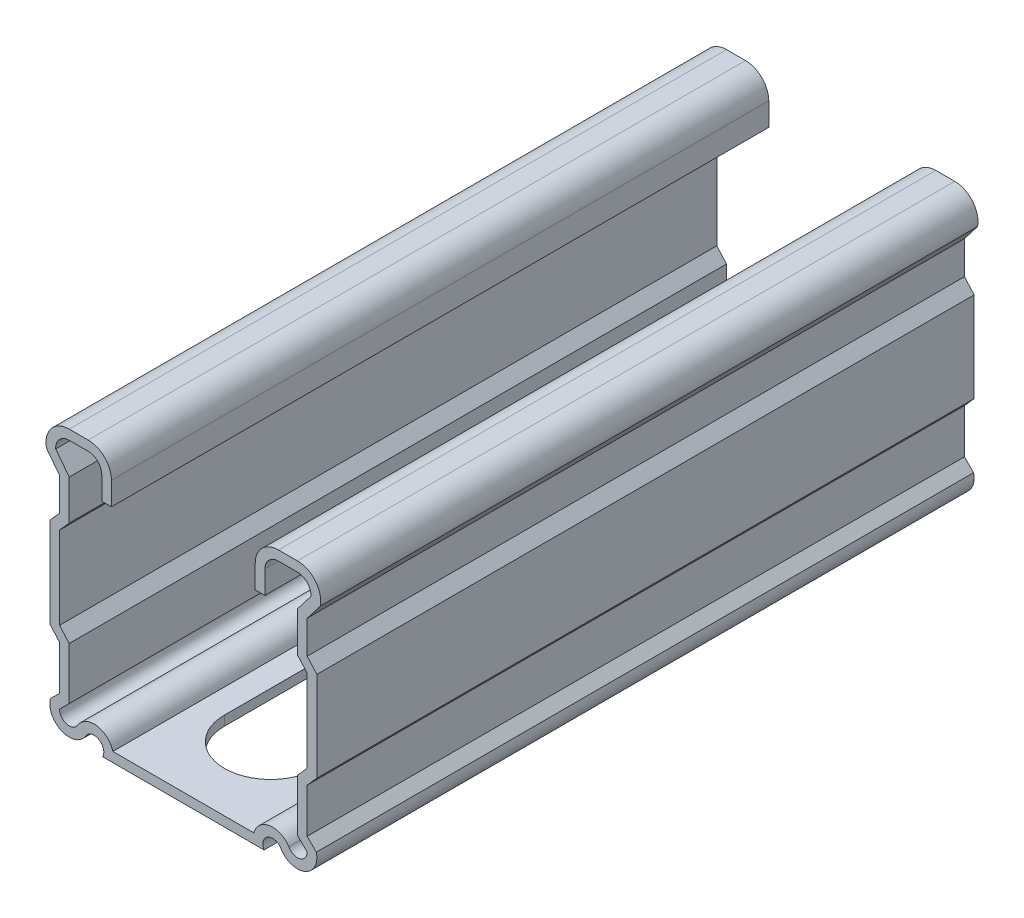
ISO-10303-21;
HEADER;
FILE_DESCRIPTION(('STEP AP214'),'2;1');
FILE_NAME('part.step','',(''),(''),'','','');
FILE_SCHEMA(('AUTOMOTIVE_DESIGN { 1 0 10303 214 1 1 1 1 }'));
ENDSEC;
DATA;
#1=APPLICATION_CONTEXT('core data for automotive mechanical design processes');
#2=APPLICATION_PROTOCOL_DEFINITION('international standard','automotive_design',2000,#1);
#3=PRODUCT_CONTEXT('',#1,'mechanical');
#4=PRODUCT('Part','Part','',(#3));
#5=PRODUCT_RELATED_PRODUCT_CATEGORY('part','',(#4));
#6=PRODUCT_DEFINITION_FORMATION('','',#4);
#7=PRODUCT_DEFINITION_CONTEXT('part definition',#1,'design');
#8=PRODUCT_DEFINITION('design','',#6,#7);
#9=PRODUCT_DEFINITION_SHAPE('','',#8);
#10=(LENGTH_UNIT() NAMED_UNIT(*) SI_UNIT(.MILLI.,.METRE.));
#11=(NAMED_UNIT(*) PLANE_ANGLE_UNIT() SI_UNIT($,.RADIAN.));
#12=(NAMED_UNIT(*) SI_UNIT($,.STERADIAN.) SOLID_ANGLE_UNIT());
#13=UNCERTAINTY_MEASURE_WITH_UNIT(LENGTH_MEASURE(1.E-05),#10,'distance_accuracy_value','');
#14=(GEOMETRIC_REPRESENTATION_CONTEXT(3) GLOBAL_UNCERTAINTY_ASSIGNED_CONTEXT((#13)) GLOBAL_UNIT_ASSIGNED_CONTEXT((#10,
#11,#12)) REPRESENTATION_CONTEXT('',''));
#15=CARTESIAN_POINT('',(0.,0.,0.));
#16=DIRECTION('',(0.,0.,1.));
#17=DIRECTION('',(1.,0.,0.));
#18=AXIS2_PLACEMENT_3D('',#15,#16,#17);
#19=CARTESIAN_POINT('',(13.7938113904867,-17.794678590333,101.6));
#20=DIRECTION('',(0.,0.,-1.));
#21=DIRECTION('',(-1.,0.,0.));
#22=AXIS2_PLACEMENT_3D('',#19,#20,#21);
#23=CYLINDRICAL_SURFACE('',#22,2.9972);
#24=CARTESIAN_POINT('',(13.7938113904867,-17.794678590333,0.));
#25=DIRECTION('',(0.,0.,1.));
#26=DIRECTION('',(1.,0.,0.));
#27=AXIS2_PLACEMENT_3D('',#24,#25,#26);
#28=CIRCLE('',#27,2.9972);
#29=CARTESIAN_POINT('',(16.3051886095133,-16.158771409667,0.));
#30=VERTEX_POINT('',#29);
#31=CARTESIAN_POINT('',(10.8989921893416,-17.018,0.));
#32=VERTEX_POINT('',#31);
#33=EDGE_CURVE('E506',#30,#32,#28,.T.);
#34=ORIENTED_EDGE('',*,*,#33,.T.);
#35=DIRECTION('',(0.,0.,-1.));
#36=VECTOR('',#35,1.);
#37=CARTESIAN_POINT('',(10.8989921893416,-17.018,101.6));
#38=LINE('',#37,#36);
#39=CARTESIAN_POINT('',(10.8989921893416,-17.018,101.6));
#40=VERTEX_POINT('',#39);
#41=EDGE_CURVE('E11',#40,#32,#38,.T.);
#42=ORIENTED_EDGE('',*,*,#41,.F.);
#43=CARTESIAN_POINT('',(13.7938113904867,-17.794678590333,101.6));
#44=DIRECTION('',(0.,0.,1.));
#45=DIRECTION('',(1.,0.,0.));
#46=AXIS2_PLACEMENT_3D('',#43,#44,#45);
#47=CIRCLE('',#46,2.9972);
#48=CARTESIAN_POINT('',(16.3051886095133,-16.158771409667,101.6));
#49=VERTEX_POINT('',#48);
#50=EDGE_CURVE('E507',#49,#40,#47,.T.);
#51=ORIENTED_EDGE('',*,*,#50,.F.);
#52=DIRECTION('',(0.,0.,-1.));
#53=VECTOR('',#52,1.);
#54=CARTESIAN_POINT('',(16.3051886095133,-16.158771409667,101.6));
#55=LINE('',#54,#53);
#56=EDGE_CURVE('E621',#49,#30,#55,.T.);
#57=ORIENTED_EDGE('',*,*,#56,.T.);
#58=EDGE_LOOP('',(#34,#42,#51,#57));
#59=FACE_BOUND('',#58,.T.);
#60=ADVANCED_FACE('F39',(#59),#23,.T.);
#61=CARTESIAN_POINT('',(-10.8989921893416,-17.018,101.6));
#62=DIRECTION('',(0.,-1.,0.));
#63=DIRECTION('',(1.,0.,0.));
#64=AXIS2_PLACEMENT_3D('',#61,#62,#63);
#65=PLANE('',#64);
#66=DIRECTION('',(0.,0.,1.));
#67=VECTOR('',#66,1.);
#68=CARTESIAN_POINT('',(7.14374999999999,-17.018,152.4));
#69=LINE('',#68,#67);
#70=CARTESIAN_POINT('',(7.14375,-17.018,73.81875));
#71=VERTEX_POINT('',#70);
#72=CARTESIAN_POINT('',(7.14375,-17.018,88.10625));
#73=VERTEX_POINT('',#72);
#74=EDGE_CURVE('E467',#71,#73,#69,.T.);
#75=ORIENTED_EDGE('',*,*,#74,.T.);
#76=CARTESIAN_POINT('',(0.,-17.018,88.10625));
#77=DIRECTION('',(0.,-1.,0.));
#78=DIRECTION('',(1.,0.,0.));
#79=AXIS2_PLACEMENT_3D('',#76,#77,#78);
#80=CIRCLE('',#79,7.14375);
#81=CARTESIAN_POINT('',(-7.14375,-17.018,88.10625));
#82=VERTEX_POINT('',#81);
#83=EDGE_CURVE('E471',#73,#82,#80,.T.);
#84=ORIENTED_EDGE('',*,*,#83,.T.);
#85=DIRECTION('',(0.,0.,-1.));
#86=VECTOR('',#85,1.);
#87=CARTESIAN_POINT('',(-7.14375,-17.018,152.4));
#88=LINE('',#87,#86);
#89=CARTESIAN_POINT('',(-7.14375,-17.018,73.81875));
#90=VERTEX_POINT('',#89);
#91=EDGE_CURVE('E448',#82,#90,#88,.T.);
#92=ORIENTED_EDGE('',*,*,#91,.T.);
#93=CARTESIAN_POINT('',(0.,-17.018,73.81875));
#94=DIRECTION('',(0.,-1.,0.));
#95=DIRECTION('',(1.,0.,0.));
#96=AXIS2_PLACEMENT_3D('',#93,#94,#95);
#97=CIRCLE('',#96,7.14375);
#98=EDGE_CURVE('E53',#90,#71,#97,.T.);
#99=ORIENTED_EDGE('',*,*,#98,.T.);
#100=EDGE_LOOP('',(#75,#84,#92,#99));
#101=FACE_BOUND('',#100,.T.);
#102=DIRECTION('',(0.,0.,1.));
#103=VECTOR('',#102,1.);
#104=CARTESIAN_POINT('',(7.14374999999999,-17.018,101.6));
#105=LINE('',#104,#103);
#106=CARTESIAN_POINT('',(7.14375,-17.018,23.01875));
#107=VERTEX_POINT('',#106);
#108=CARTESIAN_POINT('',(7.14375,-17.018,37.30625));
#109=VERTEX_POINT('',#108);
#110=EDGE_CURVE('E500',#107,#109,#105,.T.);
#111=ORIENTED_EDGE('',*,*,#110,.T.);
#112=CARTESIAN_POINT('',(0.,-17.018,37.30625));
#113=DIRECTION('',(0.,-1.,0.));
#114=DIRECTION('',(1.,0.,0.));
#115=AXIS2_PLACEMENT_3D('',#112,#113,#114);
#116=CIRCLE('',#115,7.14375);
#117=CARTESIAN_POINT('',(-7.14375,-17.018,37.30625));
#118=VERTEX_POINT('',#117);
#119=EDGE_CURVE('E503',#109,#118,#116,.T.);
#120=ORIENTED_EDGE('',*,*,#119,.T.);
#121=DIRECTION('',(0.,0.,-1.));
#122=VECTOR('',#121,1.);
#123=CARTESIAN_POINT('',(-7.14375,-17.018,101.6));
#124=LINE('',#123,#122);
#125=CARTESIAN_POINT('',(-7.14375,-17.018,23.01875));
#126=VERTEX_POINT('',#125);
#127=EDGE_CURVE('E488',#118,#126,#124,.T.);
#128=ORIENTED_EDGE('',*,*,#127,.T.);
#129=CARTESIAN_POINT('',(0.,-17.018,23.01875));
#130=DIRECTION('',(0.,-1.,0.));
#131=DIRECTION('',(1.,0.,0.));
#132=AXIS2_PLACEMENT_3D('',#129,#130,#131);
#133=CIRCLE('',#132,7.14375);
#134=EDGE_CURVE('E497',#126,#107,#133,.T.);
#135=ORIENTED_EDGE('',*,*,#134,.T.);
#136=EDGE_LOOP('',(#111,#120,#128,#135));
#137=FACE_BOUND('',#136,.T.);
#138=DIRECTION('',(-1.,0.,0.));
#139=VECTOR('',#138,1.);
#140=CARTESIAN_POINT('',(-10.8989921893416,-17.018,0.));
#141=LINE('',#140,#139);
#142=CARTESIAN_POINT('',(-10.8989921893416,-17.018,0.));
#143=VERTEX_POINT('',#142);
#144=EDGE_CURVE('E624',#32,#143,#141,.T.);
#145=ORIENTED_EDGE('',*,*,#144,.T.);
#146=DIRECTION('',(0.,0.,-1.));
#147=VECTOR('',#146,1.);
#148=CARTESIAN_POINT('',(-10.8989921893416,-17.018,101.6));
#149=LINE('',#148,#147);
#150=CARTESIAN_POINT('',(-10.8989921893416,-17.018,101.6));
#151=VERTEX_POINT('',#150);
#152=EDGE_CURVE('E46',#151,#143,#149,.T.);
#153=ORIENTED_EDGE('',*,*,#152,.F.);
#154=DIRECTION('',(-1.,0.,0.));
#155=VECTOR('',#154,1.);
#156=CARTESIAN_POINT('',(-10.8989921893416,-17.018,101.6));
#157=LINE('',#156,#155);
#158=EDGE_CURVE('E510',#40,#151,#157,.T.);
#159=ORIENTED_EDGE('',*,*,#158,.F.);
#160=ORIENTED_EDGE('',*,*,#41,.T.);
#161=EDGE_LOOP('',(#145,#153,#159,#160));
#162=FACE_BOUND('',#161,.T.);
#163=ADVANCED_FACE('F921',(#101,#137,#162),#65,.F.);
#164=CARTESIAN_POINT('',(-13.7938113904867,-17.794678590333,101.6));
#165=DIRECTION('',(0.,0.,-1.));
#166=DIRECTION('',(-1.,0.,0.));
#167=AXIS2_PLACEMENT_3D('',#164,#165,#166);
#168=CYLINDRICAL_SURFACE('',#167,2.9972);
#169=CARTESIAN_POINT('',(-13.7938113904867,-17.794678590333,0.));
#170=DIRECTION('',(0.,0.,1.));
#171=DIRECTION('',(-1.,0.,0.));
#172=AXIS2_PLACEMENT_3D('',#169,#170,#171);
#173=CIRCLE('',#172,2.9972);
#174=CARTESIAN_POINT('',(-16.4142858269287,-16.3399203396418,0.));
#175=VERTEX_POINT('',#174);
#176=EDGE_CURVE('E626',#143,#175,#173,.T.);
#177=ORIENTED_EDGE('',*,*,#176,.T.);
#178=DIRECTION('',(0.,0.,-1.));
#179=VECTOR('',#178,1.);
#180=CARTESIAN_POINT('',(-16.4142858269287,-16.3399203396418,101.6));
#181=LINE('',#180,#179);
#182=CARTESIAN_POINT('',(-16.4142858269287,-16.3399203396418,101.6));
#183=VERTEX_POINT('',#182);
#184=EDGE_CURVE('E891',#183,#175,#181,.T.);
#185=ORIENTED_EDGE('',*,*,#184,.F.);
#186=CARTESIAN_POINT('',(-13.7938113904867,-17.794678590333,101.6));
#187=DIRECTION('',(0.,0.,1.));
#188=DIRECTION('',(-1.,0.,0.));
#189=AXIS2_PLACEMENT_3D('',#186,#187,#188);
#190=CIRCLE('',#189,2.9972);
#191=EDGE_CURVE('E513',#151,#183,#190,.T.);
#192=ORIENTED_EDGE('',*,*,#191,.F.);
#193=ORIENTED_EDGE('',*,*,#152,.T.);
#194=EDGE_LOOP('',(#177,#185,#192,#193));
#195=FACE_BOUND('',#194,.T.);
#196=ADVANCED_FACE('F898',(#195),#168,.T.);
#197=CARTESIAN_POINT('',(-17.6403,-15.478125,101.6));
#198=DIRECTION('',(0.,0.,-1.));
#199=DIRECTION('',(-1.,0.,0.));
#200=AXIS2_PLACEMENT_3D('',#197,#198,#199);
#201=CYLINDRICAL_SURFACE('',#200,1.4986);
#202=CARTESIAN_POINT('',(-17.6403,-15.478125,0.));
#203=DIRECTION('',(0.,0.,-1.));
#204=DIRECTION('',(1.,0.,0.));
#205=AXIS2_PLACEMENT_3D('',#202,#203,#204);
#206=CIRCLE('',#205,1.4986);
#207=CARTESIAN_POINT('',(-19.1389,-15.478125,0.));
#208=VERTEX_POINT('',#207);
#209=EDGE_CURVE('E628',#175,#208,#206,.T.);
#210=ORIENTED_EDGE('',*,*,#209,.T.);
#211=DIRECTION('',(0.,0.,-1.));
#212=VECTOR('',#211,1.);
#213=CARTESIAN_POINT('',(-19.1389,-15.478125,101.6));
#214=LINE('',#213,#212);
#215=CARTESIAN_POINT('',(-19.1389,-15.478125,101.6));
#216=VERTEX_POINT('',#215);
#217=EDGE_CURVE('E888',#216,#208,#214,.T.);
#218=ORIENTED_EDGE('',*,*,#217,.F.);
#219=CARTESIAN_POINT('',(-17.6403,-15.478125,101.6));
#220=DIRECTION('',(0.,0.,-1.));
#221=DIRECTION('',(1.,0.,0.));
#222=AXIS2_PLACEMENT_3D('',#219,#220,#221);
#223=CIRCLE('',#222,1.4986);
#224=EDGE_CURVE('E515',#183,#216,#223,.T.);
#225=ORIENTED_EDGE('',*,*,#224,.F.);
#226=ORIENTED_EDGE('',*,*,#184,.T.);
#227=EDGE_LOOP('',(#210,#218,#225,#226));
#228=FACE_BOUND('',#227,.T.);
#229=ADVANCED_FACE('F909',(#228),#201,.F.);
#230=CARTESIAN_POINT('',(-17.6403,-13.979525,101.6));
#231=DIRECTION('',(-0.707106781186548,0.707106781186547,0.));
#232=DIRECTION('',(-0.707106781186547,-0.707106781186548,0.));
#233=AXIS2_PLACEMENT_3D('',#230,#231,#232);
#234=PLANE('',#233);
#235=DIRECTION('',(0.707106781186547,0.707106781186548,0.));
#236=VECTOR('',#235,1.);
#237=CARTESIAN_POINT('',(-17.6403,-13.979525,0.));
#238=LINE('',#237,#236);
#239=CARTESIAN_POINT('',(-17.6403,-13.979525,0.));
#240=VERTEX_POINT('',#239);
#241=EDGE_CURVE('E630',#208,#240,#238,.T.);
#242=ORIENTED_EDGE('',*,*,#241,.T.);
#243=DIRECTION('',(0.,0.,-1.));
#244=VECTOR('',#243,1.);
#245=CARTESIAN_POINT('',(-17.6403,-13.979525,101.6));
#246=LINE('',#245,#244);
#247=CARTESIAN_POINT('',(-17.6403,-13.979525,101.6));
#248=VERTEX_POINT('',#247);
#249=EDGE_CURVE('E885',#248,#240,#246,.T.);
#250=ORIENTED_EDGE('',*,*,#249,.F.);
#251=DIRECTION('',(0.707106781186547,0.707106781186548,0.));
#252=VECTOR('',#251,1.);
#253=CARTESIAN_POINT('',(-17.6403,-13.979525,101.6));
#254=LINE('',#253,#252);
#255=EDGE_CURVE('E517',#216,#248,#254,.T.);
#256=ORIENTED_EDGE('',*,*,#255,.F.);
#257=ORIENTED_EDGE('',*,*,#217,.T.);
#258=EDGE_LOOP('',(#242,#250,#256,#257));
#259=FACE_BOUND('',#258,.T.);
#260=ADVANCED_FACE('F913',(#259),#234,.F.);
#261=CARTESIAN_POINT('',(-17.6403,-13.979525,101.6));
#262=DIRECTION('',(-1.,0.,0.));
#263=DIRECTION('',(0.,-1.,0.));
#264=AXIS2_PLACEMENT_3D('',#261,#262,#263);
#265=PLANE('',#264);
#266=DIRECTION('',(0.,1.,0.));
#267=VECTOR('',#266,1.);
#268=CARTESIAN_POINT('',(-17.6403,-13.979525,0.));
#269=LINE('',#268,#267);
#270=CARTESIAN_POINT('',(-17.6403,-5.93680201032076,0.));
#271=VERTEX_POINT('',#270);
#272=EDGE_CURVE('E632',#240,#271,#269,.T.);
#273=ORIENTED_EDGE('',*,*,#272,.T.);
#274=DIRECTION('',(0.,0.,-1.));
#275=VECTOR('',#274,1.);
#276=CARTESIAN_POINT('',(-17.6403,-5.93680201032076,101.6));
#277=LINE('',#276,#275);
#278=CARTESIAN_POINT('',(-17.6403,-5.93680201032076,101.6));
#279=VERTEX_POINT('',#278);
#280=EDGE_CURVE('E882',#279,#271,#277,.T.);
#281=ORIENTED_EDGE('',*,*,#280,.F.);
#282=DIRECTION('',(0.,1.,0.));
#283=VECTOR('',#282,1.);
#284=CARTESIAN_POINT('',(-17.6403,-13.979525,101.6));
#285=LINE('',#284,#283);
#286=EDGE_CURVE('E519',#248,#279,#285,.T.);
#287=ORIENTED_EDGE('',*,*,#286,.F.);
#288=ORIENTED_EDGE('',*,*,#249,.T.);
#289=EDGE_LOOP('',(#273,#281,#287,#288));
#290=FACE_BOUND('',#289,.T.);
#291=ADVANCED_FACE('F1173',(#290),#265,.F.);
#292=CARTESIAN_POINT('',(-17.6403,-5.93680201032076,101.6));
#293=DIRECTION('',(-0.746819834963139,-0.665026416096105,0.));
#294=DIRECTION('',(0.665026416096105,-0.746819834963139,0.));
#295=AXIS2_PLACEMENT_3D('',#292,#293,#294);
#296=PLANE('',#295);
#297=DIRECTION('',(-0.665026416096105,0.746819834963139,0.));
#298=VECTOR('',#297,1.);
#299=CARTESIAN_POINT('',(-17.6403,-5.93680201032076,0.));
#300=LINE('',#299,#298);
#301=CARTESIAN_POINT('',(-19.1389,-4.25388509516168,0.));
#302=VERTEX_POINT('',#301);
#303=EDGE_CURVE('E634',#271,#302,#300,.T.);
#304=ORIENTED_EDGE('',*,*,#303,.T.);
#305=DIRECTION('',(0.,0.,-1.));
#306=VECTOR('',#305,1.);
#307=CARTESIAN_POINT('',(-19.1389,-4.25388509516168,101.6));
#308=LINE('',#307,#306);
#309=CARTESIAN_POINT('',(-19.1389,-4.25388509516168,101.6));
#310=VERTEX_POINT('',#309);
#311=EDGE_CURVE('E879',#310,#302,#308,.T.);
#312=ORIENTED_EDGE('',*,*,#311,.F.);
#313=DIRECTION('',(-0.665026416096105,0.746819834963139,0.));
#314=VECTOR('',#313,1.);
#315=CARTESIAN_POINT('',(-17.6403,-5.93680201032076,101.6));
#316=LINE('',#315,#314);
#317=EDGE_CURVE('E521',#279,#310,#316,.T.);
#318=ORIENTED_EDGE('',*,*,#317,.F.);
#319=ORIENTED_EDGE('',*,*,#280,.T.);
#320=EDGE_LOOP('',(#304,#312,#318,#319));
#321=FACE_BOUND('',#320,.T.);
#322=ADVANCED_FACE('F1171',(#321),#296,.F.);
#323=CARTESIAN_POINT('',(-19.1389,-4.25388509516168,101.6));
#324=DIRECTION('',(-1.,0.,0.));
#325=DIRECTION('',(0.,0.,1.));
#326=AXIS2_PLACEMENT_3D('',#323,#324,#325);
#327=PLANE('',#326);
#328=DIRECTION('',(0.,1.,0.));
#329=VECTOR('',#328,1.);
#330=CARTESIAN_POINT('',(-19.1389,-4.25388509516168,0.));
#331=LINE('',#330,#329);
#332=CARTESIAN_POINT('',(-19.1389,8.49568509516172,0.));
#333=VERTEX_POINT('',#332);
#334=EDGE_CURVE('E636',#302,#333,#331,.T.);
#335=ORIENTED_EDGE('',*,*,#334,.T.);
#336=DIRECTION('',(0.,0.,-1.));
#337=VECTOR('',#336,1.);
#338=CARTESIAN_POINT('',(-19.1389,8.49568509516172,101.6));
#339=LINE('',#338,#337);
#340=CARTESIAN_POINT('',(-19.1389,8.49568509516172,101.6));
#341=VERTEX_POINT('',#340);
#342=EDGE_CURVE('E876',#341,#333,#339,.T.);
#343=ORIENTED_EDGE('',*,*,#342,.F.);
#344=DIRECTION('',(0.,1.,0.));
#345=VECTOR('',#344,1.);
#346=CARTESIAN_POINT('',(-19.1389,-4.25388509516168,101.6));
#347=LINE('',#346,#345);
#348=EDGE_CURVE('E523',#310,#341,#347,.T.);
#349=ORIENTED_EDGE('',*,*,#348,.F.);
#350=ORIENTED_EDGE('',*,*,#311,.T.);
#351=EDGE_LOOP('',(#335,#343,#349,#350));
#352=FACE_BOUND('',#351,.T.);
#353=ADVANCED_FACE('F1166',(#352),#327,.F.);
#354=CARTESIAN_POINT('',(-17.6403,10.178602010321,101.6));
#355=DIRECTION('',(-0.746819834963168,0.665026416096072,0.));
#356=DIRECTION('',(-0.665026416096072,-0.746819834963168,0.));
#357=AXIS2_PLACEMENT_3D('',#354,#355,#356);
#358=PLANE('',#357);
#359=DIRECTION('',(0.665026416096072,0.746819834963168,0.));
#360=VECTOR('',#359,1.);
#361=CARTESIAN_POINT('',(-17.6403,10.178602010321,0.));
#362=LINE('',#361,#360);
#363=CARTESIAN_POINT('',(-17.6403,10.178602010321,0.));
#364=VERTEX_POINT('',#363);
#365=EDGE_CURVE('E638',#333,#364,#362,.T.);
#366=ORIENTED_EDGE('',*,*,#365,.T.);
#367=DIRECTION('',(0.,0.,-1.));
#368=VECTOR('',#367,1.);
#369=CARTESIAN_POINT('',(-17.6403,10.178602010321,101.6));
#370=LINE('',#369,#368);
#371=CARTESIAN_POINT('',(-17.6403,10.178602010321,101.6));
#372=VERTEX_POINT('',#371);
#373=EDGE_CURVE('E873',#372,#364,#370,.T.);
#374=ORIENTED_EDGE('',*,*,#373,.F.);
#375=DIRECTION('',(0.665026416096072,0.746819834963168,0.));
#376=VECTOR('',#375,1.);
#377=CARTESIAN_POINT('',(-17.6403,10.178602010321,101.6));
#378=LINE('',#377,#376);
#379=EDGE_CURVE('E525',#341,#372,#378,.T.);
#380=ORIENTED_EDGE('',*,*,#379,.F.);
#381=ORIENTED_EDGE('',*,*,#342,.T.);
#382=EDGE_LOOP('',(#366,#374,#380,#381));
#383=FACE_BOUND('',#382,.T.);
#384=ADVANCED_FACE('F1161',(#383),#358,.F.);
#385=CARTESIAN_POINT('',(-17.6403,10.178602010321,101.6));
#386=DIRECTION('',(-1.,0.,0.));
#387=DIRECTION('',(0.,0.,1.));
#388=AXIS2_PLACEMENT_3D('',#385,#386,#387);
#389=PLANE('',#388);
#390=DIRECTION('',(0.,1.,0.));
#391=VECTOR('',#390,1.);
#392=CARTESIAN_POINT('',(-17.6403,10.178602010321,0.));
#393=LINE('',#392,#391);
#394=CARTESIAN_POINT('',(-17.6403,16.3392865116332,0.));
#395=VERTEX_POINT('',#394);
#396=EDGE_CURVE('E640',#364,#395,#393,.T.);
#397=ORIENTED_EDGE('',*,*,#396,.T.);
#398=DIRECTION('',(0.,0.,-1.));
#399=VECTOR('',#398,1.);
#400=CARTESIAN_POINT('',(-17.6403,16.3392865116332,101.6));
#401=LINE('',#400,#399);
#402=CARTESIAN_POINT('',(-17.6403,16.3392865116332,101.6));
#403=VERTEX_POINT('',#402);
#404=EDGE_CURVE('E870',#403,#395,#401,.T.);
#405=ORIENTED_EDGE('',*,*,#404,.F.);
#406=DIRECTION('',(0.,1.,0.));
#407=VECTOR('',#406,1.);
#408=CARTESIAN_POINT('',(-17.6403,10.178602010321,101.6));
#409=LINE('',#408,#407);
#410=EDGE_CURVE('E527',#372,#403,#409,.T.);
#411=ORIENTED_EDGE('',*,*,#410,.F.);
#412=ORIENTED_EDGE('',*,*,#373,.T.);
#413=EDGE_LOOP('',(#397,#405,#411,#412));
#414=FACE_BOUND('',#413,.T.);
#415=ADVANCED_FACE('F1157',(#414),#389,.F.);
#416=CARTESIAN_POINT('',(-17.6403,16.3392865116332,101.6));
#417=DIRECTION('',(-0.793466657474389,-0.608613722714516,0.));
#418=DIRECTION('',(0.608613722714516,-0.793466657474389,0.));
#419=AXIS2_PLACEMENT_3D('',#416,#417,#418);
#420=PLANE('',#419);
#421=DIRECTION('',(-0.608613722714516,0.793466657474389,0.));
#422=VECTOR('',#421,1.);
#423=CARTESIAN_POINT('',(-17.6403,16.3392865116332,0.));
#424=LINE('',#423,#422);
#425=CARTESIAN_POINT('',(-19.7298825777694,19.0635335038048,0.));
#426=VERTEX_POINT('',#425);
#427=EDGE_CURVE('E642',#395,#426,#424,.T.);
#428=ORIENTED_EDGE('',*,*,#427,.T.);
#429=DIRECTION('',(0.,0.,-1.));
#430=VECTOR('',#429,1.);
#431=CARTESIAN_POINT('',(-19.7298825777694,19.0635335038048,101.6));
#432=LINE('',#431,#430);
#433=CARTESIAN_POINT('',(-19.7298825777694,19.0635335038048,101.6));
#434=VERTEX_POINT('',#433);
#435=EDGE_CURVE('E867',#434,#426,#432,.T.);
#436=ORIENTED_EDGE('',*,*,#435,.F.);
#437=DIRECTION('',(-0.608613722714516,0.793466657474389,0.));
#438=VECTOR('',#437,1.);
#439=CARTESIAN_POINT('',(-17.6403,16.3392865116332,101.6));
#440=LINE('',#439,#438);
#441=EDGE_CURVE('E529',#403,#434,#440,.T.);
#442=ORIENTED_EDGE('',*,*,#441,.F.);
#443=ORIENTED_EDGE('',*,*,#404,.T.);
#444=EDGE_LOOP('',(#428,#436,#442,#443));
#445=FACE_BOUND('',#444,.T.);
#446=ADVANCED_FACE('F1152',(#445),#420,.F.);
#447=CARTESIAN_POINT('',(-17.6403,19.1676263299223,101.6));
#448=DIRECTION('',(0.,0.,-1.));
#449=DIRECTION('',(-1.,0.,0.));
#450=AXIS2_PLACEMENT_3D('',#447,#448,#449);
#451=CYLINDRICAL_SURFACE('',#450,2.09217367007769);
#452=CARTESIAN_POINT('',(-17.6403,19.1676263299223,0.));
#453=DIRECTION('',(0.,0.,-1.));
#454=DIRECTION('',(1.,0.,0.));
#455=AXIS2_PLACEMENT_3D('',#452,#453,#454);
#456=CIRCLE('',#455,2.09217367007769);
#457=CARTESIAN_POINT('',(-17.6403,21.2598,0.));
#458=VERTEX_POINT('',#457);
#459=EDGE_CURVE('E644',#426,#458,#456,.T.);
#460=ORIENTED_EDGE('',*,*,#459,.T.);
#461=DIRECTION('',(0.,0.,-1.));
#462=VECTOR('',#461,1.);
#463=CARTESIAN_POINT('',(-17.6403,21.2598,101.6));
#464=LINE('',#463,#462);
#465=CARTESIAN_POINT('',(-17.6403,21.2598,101.6));
#466=VERTEX_POINT('',#465);
#467=EDGE_CURVE('E864',#466,#458,#464,.T.);
#468=ORIENTED_EDGE('',*,*,#467,.F.);
#469=CARTESIAN_POINT('',(-17.6403,19.1676263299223,101.6));
#470=DIRECTION('',(0.,0.,-1.));
#471=DIRECTION('',(1.,0.,0.));
#472=AXIS2_PLACEMENT_3D('',#469,#470,#471);
#473=CIRCLE('',#472,2.09217367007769);
#474=EDGE_CURVE('E531',#434,#466,#473,.T.);
#475=ORIENTED_EDGE('',*,*,#474,.F.);
#476=ORIENTED_EDGE('',*,*,#435,.T.);
#477=EDGE_LOOP('',(#460,#468,#475,#476));
#478=FACE_BOUND('',#477,.T.);
#479=ADVANCED_FACE('F1146',(#478),#451,.F.);
#480=CARTESIAN_POINT('',(-17.6403,21.2598,101.6));
#481=DIRECTION('',(0.,1.,0.));
#482=DIRECTION('',(0.,0.,1.));
#483=AXIS2_PLACEMENT_3D('',#480,#481,#482);
#484=PLANE('',#483);
#485=DIRECTION('',(1.,0.,0.));
#486=VECTOR('',#485,1.);
#487=CARTESIAN_POINT('',(-17.6403,21.2598,0.));
#488=LINE('',#487,#486);
#489=CARTESIAN_POINT('',(-14.7032736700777,21.2598,0.));
#490=VERTEX_POINT('',#489);
#491=EDGE_CURVE('E646',#458,#490,#488,.T.);
#492=ORIENTED_EDGE('',*,*,#491,.T.);
#493=DIRECTION('',(0.,0.,-1.));
#494=VECTOR('',#493,1.);
#495=CARTESIAN_POINT('',(-14.7032736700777,21.2598,101.6));
#496=LINE('',#495,#494);
#497=CARTESIAN_POINT('',(-14.7032736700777,21.2598,101.6));
#498=VERTEX_POINT('',#497);
#499=EDGE_CURVE('E861',#498,#490,#496,.T.);
#500=ORIENTED_EDGE('',*,*,#499,.F.);
#501=DIRECTION('',(1.,0.,0.));
#502=VECTOR('',#501,1.);
#503=CARTESIAN_POINT('',(-17.6403,21.2598,101.6));
#504=LINE('',#503,#502);
#505=EDGE_CURVE('E533',#466,#498,#504,.T.);
#506=ORIENTED_EDGE('',*,*,#505,.F.);
#507=ORIENTED_EDGE('',*,*,#467,.T.);
#508=EDGE_LOOP('',(#492,#500,#506,#507));
#509=FACE_BOUND('',#508,.T.);
#510=ADVANCED_FACE('F1142',(#509),#484,.F.);
#511=CARTESIAN_POINT('',(-14.7032736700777,19.1676263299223,101.6));
#512=DIRECTION('',(0.,0.,-1.));
#513=DIRECTION('',(-1.,0.,0.));
#514=AXIS2_PLACEMENT_3D('',#511,#512,#513);
#515=CYLINDRICAL_SURFACE('',#514,2.09217367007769);
#516=CARTESIAN_POINT('',(-14.7032736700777,19.1676263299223,0.));
#517=DIRECTION('',(0.,0.,-1.));
#518=DIRECTION('',(1.,0.,0.));
#519=AXIS2_PLACEMENT_3D('',#516,#517,#518);
#520=CIRCLE('',#519,2.09217367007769);
#521=CARTESIAN_POINT('',(-12.6111,19.1676263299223,0.));
#522=VERTEX_POINT('',#521);
#523=EDGE_CURVE('E648',#490,#522,#520,.T.);
#524=ORIENTED_EDGE('',*,*,#523,.T.);
#525=DIRECTION('',(0.,0.,-1.));
#526=VECTOR('',#525,1.);
#527=CARTESIAN_POINT('',(-12.6111,19.1676263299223,101.6));
#528=LINE('',#527,#526);
#529=CARTESIAN_POINT('',(-12.6111,19.1676263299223,101.6));
#530=VERTEX_POINT('',#529);
#531=EDGE_CURVE('E858',#530,#522,#528,.T.);
#532=ORIENTED_EDGE('',*,*,#531,.F.);
#533=CARTESIAN_POINT('',(-14.7032736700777,19.1676263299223,101.6));
#534=DIRECTION('',(0.,0.,-1.));
#535=DIRECTION('',(1.,0.,0.));
#536=AXIS2_PLACEMENT_3D('',#533,#534,#535);
#537=CIRCLE('',#536,2.09217367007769);
#538=EDGE_CURVE('E535',#498,#530,#537,.T.);
#539=ORIENTED_EDGE('',*,*,#538,.F.);
#540=ORIENTED_EDGE('',*,*,#499,.T.);
#541=EDGE_LOOP('',(#524,#532,#539,#540));
#542=FACE_BOUND('',#541,.T.);
#543=ADVANCED_FACE('F1137',(#542),#515,.F.);
#544=CARTESIAN_POINT('',(-12.6111,19.1676263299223,101.6));
#545=DIRECTION('',(1.,0.,0.));
#546=DIRECTION('',(0.,0.,-1.));
#547=AXIS2_PLACEMENT_3D('',#544,#545,#546);
#548=PLANE('',#547);
#549=DIRECTION('',(0.,-1.,0.));
#550=VECTOR('',#549,1.);
#551=CARTESIAN_POINT('',(-12.6111,19.1676263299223,0.));
#552=LINE('',#551,#550);
#553=CARTESIAN_POINT('',(-12.6111,15.61465,0.));
#554=VERTEX_POINT('',#553);
#555=EDGE_CURVE('E650',#522,#554,#552,.T.);
#556=ORIENTED_EDGE('',*,*,#555,.T.);
#557=DIRECTION('',(0.,0.,-1.));
#558=VECTOR('',#557,1.);
#559=CARTESIAN_POINT('',(-12.6111,15.61465,101.6));
#560=LINE('',#559,#558);
#561=CARTESIAN_POINT('',(-12.6111,15.61465,101.6));
#562=VERTEX_POINT('',#561);
#563=EDGE_CURVE('E855',#562,#554,#560,.T.);
#564=ORIENTED_EDGE('',*,*,#563,.F.);
#565=DIRECTION('',(0.,-1.,0.));
#566=VECTOR('',#565,1.);
#567=CARTESIAN_POINT('',(-12.6111,19.1676263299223,101.6));
#568=LINE('',#567,#566);
#569=EDGE_CURVE('E537',#530,#562,#568,.T.);
#570=ORIENTED_EDGE('',*,*,#569,.F.);
#571=ORIENTED_EDGE('',*,*,#531,.T.);
#572=EDGE_LOOP('',(#556,#564,#570,#571));
#573=FACE_BOUND('',#572,.T.);
#574=ADVANCED_FACE('F1131',(#573),#548,.F.);
#575=CARTESIAN_POINT('',(-12.6111,15.61465,101.6));
#576=DIRECTION('',(0.,1.,0.));
#577=DIRECTION('',(0.,0.,1.));
#578=AXIS2_PLACEMENT_3D('',#575,#576,#577);
#579=PLANE('',#578);
#580=DIRECTION('',(1.,0.,0.));
#581=VECTOR('',#580,1.);
#582=CARTESIAN_POINT('',(-12.6111,15.61465,0.));
#583=LINE('',#582,#581);
#584=CARTESIAN_POINT('',(-11.1125,15.61465,0.));
#585=VERTEX_POINT('',#584);
#586=EDGE_CURVE('E652',#554,#585,#583,.T.);
#587=ORIENTED_EDGE('',*,*,#586,.T.);
#588=DIRECTION('',(0.,0.,-1.));
#589=VECTOR('',#588,1.);
#590=CARTESIAN_POINT('',(-11.1125,15.61465,101.6));
#591=LINE('',#590,#589);
#592=CARTESIAN_POINT('',(-11.1125,15.61465,101.6));
#593=VERTEX_POINT('',#592);
#594=EDGE_CURVE('E852',#593,#585,#591,.T.);
#595=ORIENTED_EDGE('',*,*,#594,.F.);
#596=DIRECTION('',(1.,0.,0.));
#597=VECTOR('',#596,1.);
#598=CARTESIAN_POINT('',(-12.6111,15.61465,101.6));
#599=LINE('',#598,#597);
#600=EDGE_CURVE('E539',#562,#593,#599,.T.);
#601=ORIENTED_EDGE('',*,*,#600,.F.);
#602=ORIENTED_EDGE('',*,*,#563,.T.);
#603=EDGE_LOOP('',(#587,#595,#601,#602));
#604=FACE_BOUND('',#603,.T.);
#605=ADVANCED_FACE('F1127',(#604),#579,.F.);
#606=CARTESIAN_POINT('',(-11.1125,19.1676263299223,101.6));
#607=DIRECTION('',(-1.,0.,0.));
#608=DIRECTION('',(0.,0.,1.));
#609=AXIS2_PLACEMENT_3D('',#606,#607,#608);
#610=PLANE('',#609);
#611=DIRECTION('',(0.,1.,0.));
#612=VECTOR('',#611,1.);
#613=CARTESIAN_POINT('',(-11.1125,19.1676263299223,0.));
#614=LINE('',#613,#612);
#615=CARTESIAN_POINT('',(-11.1125,19.1676263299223,0.));
#616=VERTEX_POINT('',#615);
#617=EDGE_CURVE('E654',#585,#616,#614,.T.);
#618=ORIENTED_EDGE('',*,*,#617,.T.);
#619=DIRECTION('',(0.,0.,-1.));
#620=VECTOR('',#619,1.);
#621=CARTESIAN_POINT('',(-11.1125,19.1676263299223,101.6));
#622=LINE('',#621,#620);
#623=CARTESIAN_POINT('',(-11.1125,19.1676263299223,101.6));
#624=VERTEX_POINT('',#623);
#625=EDGE_CURVE('E849',#624,#616,#622,.T.);
#626=ORIENTED_EDGE('',*,*,#625,.F.);
#627=DIRECTION('',(0.,1.,0.));
#628=VECTOR('',#627,1.);
#629=CARTESIAN_POINT('',(-11.1125,19.1676263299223,101.6));
#630=LINE('',#629,#628);
#631=EDGE_CURVE('E541',#593,#624,#630,.T.);
#632=ORIENTED_EDGE('',*,*,#631,.F.);
#633=ORIENTED_EDGE('',*,*,#594,.T.);
#634=EDGE_LOOP('',(#618,#626,#632,#633));
#635=FACE_BOUND('',#634,.T.);
#636=ADVANCED_FACE('F1122',(#635),#610,.F.);
#637=CARTESIAN_POINT('',(-14.7032736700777,19.1676263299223,101.6));
#638=DIRECTION('',(0.,0.,-1.));
#639=DIRECTION('',(-1.,0.,0.));
#640=AXIS2_PLACEMENT_3D('',#637,#638,#639);
#641=CYLINDRICAL_SURFACE('',#640,3.59077367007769);
#642=CARTESIAN_POINT('',(-14.7032736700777,19.1676263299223,0.));
#643=DIRECTION('',(0.,0.,1.));
#644=DIRECTION('',(1.,0.,0.));
#645=AXIS2_PLACEMENT_3D('',#642,#643,#644);
#646=CIRCLE('',#645,3.59077367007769);
#647=CARTESIAN_POINT('',(-14.7032736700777,22.7584,0.));
#648=VERTEX_POINT('',#647);
#649=EDGE_CURVE('E656',#616,#648,#646,.T.);
#650=ORIENTED_EDGE('',*,*,#649,.T.);
#651=DIRECTION('',(0.,0.,-1.));
#652=VECTOR('',#651,1.);
#653=CARTESIAN_POINT('',(-14.7032736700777,22.7584,101.6));
#654=LINE('',#653,#652);
#655=CARTESIAN_POINT('',(-14.7032736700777,22.7584,101.6));
#656=VERTEX_POINT('',#655);
#657=EDGE_CURVE('E846',#656,#648,#654,.T.);
#658=ORIENTED_EDGE('',*,*,#657,.F.);
#659=CARTESIAN_POINT('',(-14.7032736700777,19.1676263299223,101.6));
#660=DIRECTION('',(0.,0.,1.));
#661=DIRECTION('',(1.,0.,0.));
#662=AXIS2_PLACEMENT_3D('',#659,#660,#661);
#663=CIRCLE('',#662,3.59077367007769);
#664=EDGE_CURVE('E543',#624,#656,#663,.T.);
#665=ORIENTED_EDGE('',*,*,#664,.F.);
#666=ORIENTED_EDGE('',*,*,#625,.T.);
#667=EDGE_LOOP('',(#650,#658,#665,#666));
#668=FACE_BOUND('',#667,.T.);
#669=ADVANCED_FACE('F1116',(#668),#641,.T.);
#670=CARTESIAN_POINT('',(-17.6403,22.7584,101.6));
#671=DIRECTION('',(0.,-1.,0.));
#672=DIRECTION('',(1.,0.,0.));
#673=AXIS2_PLACEMENT_3D('',#670,#671,#672);
#674=PLANE('',#673);
#675=DIRECTION('',(-1.,0.,0.));
#676=VECTOR('',#675,1.);
#677=CARTESIAN_POINT('',(-17.6403,22.7584,0.));
#678=LINE('',#677,#676);
#679=CARTESIAN_POINT('',(-17.6403,22.7584,0.));
#680=VERTEX_POINT('',#679);
#681=EDGE_CURVE('E658',#648,#680,#678,.T.);
#682=ORIENTED_EDGE('',*,*,#681,.T.);
#683=DIRECTION('',(0.,0.,-1.));
#684=VECTOR('',#683,1.);
#685=CARTESIAN_POINT('',(-17.6403,22.7584,101.6));
#686=LINE('',#685,#684);
#687=CARTESIAN_POINT('',(-17.6403,22.7584,101.6));
#688=VERTEX_POINT('',#687);
#689=EDGE_CURVE('E843',#688,#680,#686,.T.);
#690=ORIENTED_EDGE('',*,*,#689,.F.);
#691=DIRECTION('',(-1.,0.,0.));
#692=VECTOR('',#691,1.);
#693=CARTESIAN_POINT('',(-17.6403,22.7584,101.6));
#694=LINE('',#693,#692);
#695=EDGE_CURVE('E545',#656,#688,#694,.T.);
#696=ORIENTED_EDGE('',*,*,#695,.F.);
#697=ORIENTED_EDGE('',*,*,#657,.T.);
#698=EDGE_LOOP('',(#682,#690,#696,#697));
#699=FACE_BOUND('',#698,.T.);
#700=ADVANCED_FACE('F1112',(#699),#674,.F.);
#701=CARTESIAN_POINT('',(-17.6403,19.1676263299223,101.6));
#702=DIRECTION('',(0.,0.,-1.));
#703=DIRECTION('',(-1.,0.,0.));
#704=AXIS2_PLACEMENT_3D('',#701,#702,#703);
#705=CYLINDRICAL_SURFACE('',#704,3.59077367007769);
#706=CARTESIAN_POINT('',(-17.6403,19.1676263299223,0.));
#707=DIRECTION('',(0.,0.,1.));
#708=DIRECTION('',(1.,0.,0.));
#709=AXIS2_PLACEMENT_3D('',#706,#707,#708);
#710=CIRCLE('',#709,3.59077367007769);
#711=CARTESIAN_POINT('',(-21.1624286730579,18.4688666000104,0.));
#712=VERTEX_POINT('',#711);
#713=EDGE_CURVE('E660',#680,#712,#710,.T.);
#714=ORIENTED_EDGE('',*,*,#713,.T.);
#715=DIRECTION('',(0.,0.,-1.));
#716=VECTOR('',#715,1.);
#717=CARTESIAN_POINT('',(-21.1624286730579,18.4688666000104,101.6));
#718=LINE('',#717,#716);
#719=CARTESIAN_POINT('',(-21.1624286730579,18.4688666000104,101.6));
#720=VERTEX_POINT('',#719);
#721=EDGE_CURVE('E840',#720,#712,#718,.T.);
#722=ORIENTED_EDGE('',*,*,#721,.F.);
#723=CARTESIAN_POINT('',(-17.6403,19.1676263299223,101.6));
#724=DIRECTION('',(0.,0.,1.));
#725=DIRECTION('',(1.,0.,0.));
#726=AXIS2_PLACEMENT_3D('',#723,#724,#725);
#727=CIRCLE('',#726,3.59077367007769);
#728=EDGE_CURVE('E547',#688,#720,#727,.T.);
#729=ORIENTED_EDGE('',*,*,#728,.F.);
#730=ORIENTED_EDGE('',*,*,#689,.T.);
#731=EDGE_LOOP('',(#714,#722,#729,#730));
#732=FACE_BOUND('',#731,.T.);
#733=ADVANCED_FACE('F1107',(#732),#705,.T.);
#734=CARTESIAN_POINT('',(-19.1389,15.8307359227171,101.6));
#735=DIRECTION('',(0.793466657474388,0.608613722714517,0.));
#736=DIRECTION('',(-0.608613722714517,0.793466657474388,0.));
#737=AXIS2_PLACEMENT_3D('',#734,#735,#736);
#738=PLANE('',#737);
#739=DIRECTION('',(0.608613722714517,-0.793466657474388,0.));
#740=VECTOR('',#739,1.);
#741=CARTESIAN_POINT('',(-19.1389,15.8307359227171,0.));
#742=LINE('',#741,#740);
#743=CARTESIAN_POINT('',(-19.1389,15.8307359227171,0.));
#744=VERTEX_POINT('',#743);
#745=EDGE_CURVE('E662',#712,#744,#742,.T.);
#746=ORIENTED_EDGE('',*,*,#745,.T.);
#747=DIRECTION('',(0.,0.,-1.));
#748=VECTOR('',#747,1.);
#749=CARTESIAN_POINT('',(-19.1389,15.8307359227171,101.6));
#750=LINE('',#749,#748);
#751=CARTESIAN_POINT('',(-19.1389,15.8307359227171,101.6));
#752=VERTEX_POINT('',#751);
#753=EDGE_CURVE('E837',#752,#744,#750,.T.);
#754=ORIENTED_EDGE('',*,*,#753,.F.);
#755=DIRECTION('',(0.608613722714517,-0.793466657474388,0.));
#756=VECTOR('',#755,1.);
#757=CARTESIAN_POINT('',(-19.1389,15.8307359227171,101.6));
#758=LINE('',#757,#756);
#759=EDGE_CURVE('E549',#720,#752,#758,.T.);
#760=ORIENTED_EDGE('',*,*,#759,.F.);
#761=ORIENTED_EDGE('',*,*,#721,.T.);
#762=EDGE_LOOP('',(#746,#754,#760,#761));
#763=FACE_BOUND('',#762,.T.);
#764=ADVANCED_FACE('F1101',(#763),#738,.F.);
#765=CARTESIAN_POINT('',(-19.1389,10.7491294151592,101.6));
#766=DIRECTION('',(1.,0.,0.));
#767=DIRECTION('',(0.,0.,-1.));
#768=AXIS2_PLACEMENT_3D('',#765,#766,#767);
#769=PLANE('',#768);
#770=DIRECTION('',(0.,-1.,0.));
#771=VECTOR('',#770,1.);
#772=CARTESIAN_POINT('',(-19.1389,10.7491294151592,0.));
#773=LINE('',#772,#771);
#774=CARTESIAN_POINT('',(-19.1389,10.7491294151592,0.));
#775=VERTEX_POINT('',#774);
#776=EDGE_CURVE('E664',#744,#775,#773,.T.);
#777=ORIENTED_EDGE('',*,*,#776,.T.);
#778=DIRECTION('',(0.,0.,-1.));
#779=VECTOR('',#778,1.);
#780=CARTESIAN_POINT('',(-19.1389,10.7491294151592,101.6));
#781=LINE('',#780,#779);
#782=CARTESIAN_POINT('',(-19.1389,10.7491294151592,101.6));
#783=VERTEX_POINT('',#782);
#784=EDGE_CURVE('E834',#783,#775,#781,.T.);
#785=ORIENTED_EDGE('',*,*,#784,.F.);
#786=DIRECTION('',(0.,-1.,0.));
#787=VECTOR('',#786,1.);
#788=CARTESIAN_POINT('',(-19.1389,10.7491294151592,101.6));
#789=LINE('',#788,#787);
#790=EDGE_CURVE('E551',#752,#783,#789,.T.);
#791=ORIENTED_EDGE('',*,*,#790,.F.);
#792=ORIENTED_EDGE('',*,*,#753,.T.);
#793=EDGE_LOOP('',(#777,#785,#791,#792));
#794=FACE_BOUND('',#793,.T.);
#795=ADVANCED_FACE('F1097',(#794),#769,.F.);
#796=CARTESIAN_POINT('',(-19.1389,10.7491294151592,101.6));
#797=DIRECTION('',(0.746819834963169,-0.665026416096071,0.));
#798=DIRECTION('',(0.665026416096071,0.746819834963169,0.));
#799=AXIS2_PLACEMENT_3D('',#796,#797,#798);
#800=PLANE('',#799);
#801=DIRECTION('',(-0.665026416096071,-0.746819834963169,0.));
#802=VECTOR('',#801,1.);
#803=CARTESIAN_POINT('',(-19.1389,10.7491294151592,0.));
#804=LINE('',#803,#802);
#805=CARTESIAN_POINT('',(-20.6375,9.0662125,0.));
#806=VERTEX_POINT('',#805);
#807=EDGE_CURVE('E666',#775,#806,#804,.T.);
#808=ORIENTED_EDGE('',*,*,#807,.T.);
#809=DIRECTION('',(0.,0.,-1.));
#810=VECTOR('',#809,1.);
#811=CARTESIAN_POINT('',(-20.6375,9.0662125,101.6));
#812=LINE('',#811,#810);
#813=CARTESIAN_POINT('',(-20.6375,9.0662125,101.6));
#814=VERTEX_POINT('',#813);
#815=EDGE_CURVE('E831',#814,#806,#812,.T.);
#816=ORIENTED_EDGE('',*,*,#815,.F.);
#817=DIRECTION('',(-0.665026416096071,-0.746819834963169,0.));
#818=VECTOR('',#817,1.);
#819=CARTESIAN_POINT('',(-19.1389,10.7491294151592,101.6));
#820=LINE('',#819,#818);
#821=EDGE_CURVE('E553',#783,#814,#820,.T.);
#822=ORIENTED_EDGE('',*,*,#821,.F.);
#823=ORIENTED_EDGE('',*,*,#784,.T.);
#824=EDGE_LOOP('',(#808,#816,#822,#823));
#825=FACE_BOUND('',#824,.T.);
#826=ADVANCED_FACE('F1092',(#825),#800,.F.);
#827=CARTESIAN_POINT('',(-20.6375,-4.8244125,101.6));
#828=DIRECTION('',(1.,0.,0.));
#829=DIRECTION('',(0.,1.,0.));
#830=AXIS2_PLACEMENT_3D('',#827,#828,#829);
#831=PLANE('',#830);
#832=DIRECTION('',(0.,-1.,0.));
#833=VECTOR('',#832,1.);
#834=CARTESIAN_POINT('',(-20.6375,-4.8244125,0.));
#835=LINE('',#834,#833);
#836=CARTESIAN_POINT('',(-20.6375,-4.8244125,0.));
#837=VERTEX_POINT('',#836);
#838=EDGE_CURVE('E668',#806,#837,#835,.T.);
#839=ORIENTED_EDGE('',*,*,#838,.T.);
#840=DIRECTION('',(0.,0.,-1.));
#841=VECTOR('',#840,1.);
#842=CARTESIAN_POINT('',(-20.6375,-4.8244125,101.6));
#843=LINE('',#842,#841);
#844=CARTESIAN_POINT('',(-20.6375,-4.8244125,101.6));
#845=VERTEX_POINT('',#844);
#846=EDGE_CURVE('E828',#845,#837,#843,.T.);
#847=ORIENTED_EDGE('',*,*,#846,.F.);
#848=DIRECTION('',(0.,-1.,0.));
#849=VECTOR('',#848,1.);
#850=CARTESIAN_POINT('',(-20.6375,-4.8244125,101.6));
#851=LINE('',#850,#849);
#852=EDGE_CURVE('E555',#814,#845,#851,.T.);
#853=ORIENTED_EDGE('',*,*,#852,.F.);
#854=ORIENTED_EDGE('',*,*,#815,.T.);
#855=EDGE_LOOP('',(#839,#847,#853,#854));
#856=FACE_BOUND('',#855,.T.);
#857=ADVANCED_FACE('F1086',(#856),#831,.F.);
#858=CARTESIAN_POINT('',(-19.1389,-6.50732941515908,101.6));
#859=DIRECTION('',(0.746819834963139,0.665026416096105,0.));
#860=DIRECTION('',(-0.665026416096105,0.746819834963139,0.));
#861=AXIS2_PLACEMENT_3D('',#858,#859,#860);
#862=PLANE('',#861);
#863=DIRECTION('',(0.665026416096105,-0.746819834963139,0.));
#864=VECTOR('',#863,1.);
#865=CARTESIAN_POINT('',(-19.1389,-6.50732941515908,0.));
#866=LINE('',#865,#864);
#867=CARTESIAN_POINT('',(-19.1389,-6.50732941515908,0.));
#868=VERTEX_POINT('',#867);
#869=EDGE_CURVE('E670',#837,#868,#866,.T.);
#870=ORIENTED_EDGE('',*,*,#869,.T.);
#871=DIRECTION('',(0.,0.,-1.));
#872=VECTOR('',#871,1.);
#873=CARTESIAN_POINT('',(-19.1389,-6.50732941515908,101.6));
#874=LINE('',#873,#872);
#875=CARTESIAN_POINT('',(-19.1389,-6.50732941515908,101.6));
#876=VERTEX_POINT('',#875);
#877=EDGE_CURVE('E825',#876,#868,#874,.T.);
#878=ORIENTED_EDGE('',*,*,#877,.F.);
#879=DIRECTION('',(0.665026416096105,-0.746819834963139,0.));
#880=VECTOR('',#879,1.);
#881=CARTESIAN_POINT('',(-19.1389,-6.50732941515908,101.6));
#882=LINE('',#881,#880);
#883=EDGE_CURVE('E557',#845,#876,#882,.T.);
#884=ORIENTED_EDGE('',*,*,#883,.F.);
#885=ORIENTED_EDGE('',*,*,#846,.T.);
#886=EDGE_LOOP('',(#870,#878,#884,#885));
#887=FACE_BOUND('',#886,.T.);
#888=ADVANCED_FACE('F1082',(#887),#862,.F.);
#889=CARTESIAN_POINT('',(-19.1389,-13.3587845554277,101.6));
#890=DIRECTION('',(1.,0.,0.));
#891=DIRECTION('',(0.,0.,-1.));
#892=AXIS2_PLACEMENT_3D('',#889,#890,#891);
#893=PLANE('',#892);
#894=DIRECTION('',(0.,-1.,0.));
#895=VECTOR('',#894,1.);
#896=CARTESIAN_POINT('',(-19.1389,-13.3587845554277,0.));
#897=LINE('',#896,#895);
#898=CARTESIAN_POINT('',(-19.1389,-13.3587845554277,0.));
#899=VERTEX_POINT('',#898);
#900=EDGE_CURVE('E672',#868,#899,#897,.T.);
#901=ORIENTED_EDGE('',*,*,#900,.T.);
#902=DIRECTION('',(0.,0.,-1.));
#903=VECTOR('',#902,1.);
#904=CARTESIAN_POINT('',(-19.1389,-13.3587845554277,101.6));
#905=LINE('',#904,#903);
#906=CARTESIAN_POINT('',(-19.1389,-13.3587845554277,101.6));
#907=VERTEX_POINT('',#906);
#908=EDGE_CURVE('E822',#907,#899,#905,.T.);
#909=ORIENTED_EDGE('',*,*,#908,.F.);
#910=DIRECTION('',(0.,-1.,0.));
#911=VECTOR('',#910,1.);
#912=CARTESIAN_POINT('',(-19.1389,-13.3587845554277,101.6));
#913=LINE('',#912,#911);
#914=EDGE_CURVE('E559',#876,#907,#913,.T.);
#915=ORIENTED_EDGE('',*,*,#914,.F.);
#916=ORIENTED_EDGE('',*,*,#877,.T.);
#917=EDGE_LOOP('',(#901,#909,#915,#916));
#918=FACE_BOUND('',#917,.T.);
#919=ADVANCED_FACE('F1077',(#918),#893,.F.);
#920=CARTESIAN_POINT('',(-19.1389,-13.3587845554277,101.6));
#921=DIRECTION('',(0.707106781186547,-0.707106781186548,0.));
#922=DIRECTION('',(0.707106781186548,0.707106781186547,0.));
#923=AXIS2_PLACEMENT_3D('',#920,#921,#922);
#924=PLANE('',#923);
#925=DIRECTION('',(-0.707106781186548,-0.707106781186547,0.));
#926=VECTOR('',#925,1.);
#927=CARTESIAN_POINT('',(-19.1389,-13.3587845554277,0.));
#928=LINE('',#927,#926);
#929=CARTESIAN_POINT('',(-20.5534580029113,-14.773342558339,0.));
#930=VERTEX_POINT('',#929);
#931=EDGE_CURVE('E674',#899,#930,#928,.T.);
#932=ORIENTED_EDGE('',*,*,#931,.T.);
#933=DIRECTION('',(0.,0.,-1.));
#934=VECTOR('',#933,1.);
#935=CARTESIAN_POINT('',(-20.5534580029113,-14.773342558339,101.6));
#936=LINE('',#935,#934);
#937=CARTESIAN_POINT('',(-20.5534580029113,-14.773342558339,101.6));
#938=VERTEX_POINT('',#937);
#939=EDGE_CURVE('E819',#938,#930,#936,.T.);
#940=ORIENTED_EDGE('',*,*,#939,.F.);
#941=DIRECTION('',(-0.707106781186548,-0.707106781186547,0.));
#942=VECTOR('',#941,1.);
#943=CARTESIAN_POINT('',(-19.1389,-13.3587845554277,101.6));
#944=LINE('',#943,#942);
#945=EDGE_CURVE('E561',#907,#938,#944,.T.);
#946=ORIENTED_EDGE('',*,*,#945,.F.);
#947=ORIENTED_EDGE('',*,*,#908,.T.);
#948=EDGE_LOOP('',(#932,#940,#946,#947));
#949=FACE_BOUND('',#948,.T.);
#950=ADVANCED_FACE('F1071',(#949),#924,.F.);
#951=CARTESIAN_POINT('',(-17.6403,-15.478125,101.6));
#952=DIRECTION('',(0.,0.,-1.));
#953=DIRECTION('',(-1.,0.,0.));
#954=AXIS2_PLACEMENT_3D('',#951,#952,#953);
#955=CYLINDRICAL_SURFACE('',#954,2.9972);
#956=CARTESIAN_POINT('',(-17.6403,-15.478125,0.));
#957=DIRECTION('',(0.,0.,1.));
#958=DIRECTION('',(1.,0.,0.));
#959=AXIS2_PLACEMENT_3D('',#956,#957,#958);
#960=CIRCLE('',#959,2.9972);
#961=CARTESIAN_POINT('',(-15.019825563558,-16.9328832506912,0.));
#962=VERTEX_POINT('',#961);
#963=EDGE_CURVE('E676',#930,#962,#960,.T.);
#964=ORIENTED_EDGE('',*,*,#963,.T.);
#965=DIRECTION('',(0.,0.,-1.));
#966=VECTOR('',#965,1.);
#967=CARTESIAN_POINT('',(-15.019825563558,-16.9328832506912,101.6));
#968=LINE('',#967,#966);
#969=CARTESIAN_POINT('',(-15.019825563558,-16.9328832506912,101.6));
#970=VERTEX_POINT('',#969);
#971=EDGE_CURVE('E816',#970,#962,#968,.T.);
#972=ORIENTED_EDGE('',*,*,#971,.F.);
#973=CARTESIAN_POINT('',(-17.6403,-15.478125,101.6));
#974=DIRECTION('',(0.,0.,1.));
#975=DIRECTION('',(1.,0.,0.));
#976=AXIS2_PLACEMENT_3D('',#973,#974,#975);
#977=CIRCLE('',#976,2.9972);
#978=EDGE_CURVE('E563',#938,#970,#977,.T.);
#979=ORIENTED_EDGE('',*,*,#978,.F.);
#980=ORIENTED_EDGE('',*,*,#939,.T.);
#981=EDGE_LOOP('',(#964,#972,#979,#980));
#982=FACE_BOUND('',#981,.T.);
#983=ADVANCED_FACE('F1067',(#982),#955,.T.);
#984=CARTESIAN_POINT('',(-13.7938113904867,-17.794678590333,101.6));
#985=DIRECTION('',(0.,0.,-1.));
#986=DIRECTION('',(-1.,0.,0.));
#987=AXIS2_PLACEMENT_3D('',#984,#985,#986);
#988=CYLINDRICAL_SURFACE('',#987,1.4986);
#989=CARTESIAN_POINT('',(-13.7938113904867,-17.794678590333,0.));
#990=DIRECTION('',(0.,0.,-1.));
#991=DIRECTION('',(-1.,0.,0.));
#992=AXIS2_PLACEMENT_3D('',#989,#990,#991);
#993=CIRCLE('',#992,1.4986);
#994=CARTESIAN_POINT('',(-12.4805591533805,-18.5166,0.));
#995=VERTEX_POINT('',#994);
#996=EDGE_CURVE('E678',#962,#995,#993,.T.);
#997=ORIENTED_EDGE('',*,*,#996,.T.);
#998=DIRECTION('',(0.,0.,-1.));
#999=VECTOR('',#998,1.);
#1000=CARTESIAN_POINT('',(-12.4805591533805,-18.5166,101.6));
#1001=LINE('',#1000,#999);
#1002=CARTESIAN_POINT('',(-12.4805591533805,-18.5166,101.6));
#1003=VERTEX_POINT('',#1002);
#1004=EDGE_CURVE('E813',#1003,#995,#1001,.T.);
#1005=ORIENTED_EDGE('',*,*,#1004,.F.);
#1006=CARTESIAN_POINT('',(-13.7938113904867,-17.794678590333,101.6));
#1007=DIRECTION('',(0.,0.,-1.));
#1008=DIRECTION('',(-1.,0.,0.));
#1009=AXIS2_PLACEMENT_3D('',#1006,#1007,#1008);
#1010=CIRCLE('',#1009,1.4986);
#1011=EDGE_CURVE('E565',#970,#1003,#1010,.T.);
#1012=ORIENTED_EDGE('',*,*,#1011,.F.);
#1013=ORIENTED_EDGE('',*,*,#971,.T.);
#1014=EDGE_LOOP('',(#997,#1005,#1012,#1013));
#1015=FACE_BOUND('',#1014,.T.);
#1016=ADVANCED_FACE('F1062',(#1015),#988,.F.);
#1017=CARTESIAN_POINT('',(-12.4805591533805,-18.5166,101.6));
#1018=DIRECTION('',(0.,1.,0.));
#1019=DIRECTION('',(0.,0.,1.));
#1020=AXIS2_PLACEMENT_3D('',#1017,#1018,#1019);
#1021=PLANE('',#1020);
#1022=DIRECTION('',(0.,0.,-1.));
#1023=VECTOR('',#1022,1.);
#1024=CARTESIAN_POINT('',(-7.14375,-18.5165999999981,73.81875));
#1025=LINE('',#1024,#1023);
#1026=CARTESIAN_POINT('',(-7.14375,-18.5166,88.10625));
#1027=VERTEX_POINT('',#1026);
#1028=CARTESIAN_POINT('',(-7.14375,-18.5165999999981,73.81875));
#1029=VERTEX_POINT('',#1028);
#1030=EDGE_CURVE('E441',#1027,#1029,#1025,.T.);
#1031=ORIENTED_EDGE('',*,*,#1030,.F.);
#1032=CARTESIAN_POINT('',(0.,-18.5165999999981,88.10625));
#1033=DIRECTION('',(0.,-1.,0.));
#1034=DIRECTION('',(0.,0.,-1.));
#1035=AXIS2_PLACEMENT_3D('',#1032,#1033,#1034);
#1036=CIRCLE('',#1035,7.14375);
#1037=CARTESIAN_POINT('',(7.14375,-18.5165999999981,88.10625));
#1038=VERTEX_POINT('',#1037);
#1039=EDGE_CURVE('E61',#1038,#1027,#1036,.T.);
#1040=ORIENTED_EDGE('',*,*,#1039,.F.);
#1041=DIRECTION('',(0.,0.,1.));
#1042=VECTOR('',#1041,1.);
#1043=CARTESIAN_POINT('',(7.14375,-18.5165999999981,88.10625));
#1044=LINE('',#1043,#1042);
#1045=CARTESIAN_POINT('',(7.14375,-18.5165999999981,73.81875));
#1046=VERTEX_POINT('',#1045);
#1047=EDGE_CURVE('E457',#1046,#1038,#1044,.T.);
#1048=ORIENTED_EDGE('',*,*,#1047,.F.);
#1049=CARTESIAN_POINT('',(0.,-18.5165999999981,73.81875));
#1050=DIRECTION('',(0.,-1.,0.));
#1051=DIRECTION('',(0.,0.,-1.));
#1052=AXIS2_PLACEMENT_3D('',#1049,#1050,#1051);
#1053=CIRCLE('',#1052,7.14375);
#1054=EDGE_CURVE('E451',#1029,#1046,#1053,.T.);
#1055=ORIENTED_EDGE('',*,*,#1054,.F.);
#1056=EDGE_LOOP('',(#1031,#1040,#1048,#1055));
#1057=FACE_BOUND('',#1056,.T.);
#1058=DIRECTION('',(0.,0.,-1.));
#1059=VECTOR('',#1058,1.);
#1060=CARTESIAN_POINT('',(-7.14375,-18.5165999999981,23.01875));
#1061=LINE('',#1060,#1059);
#1062=CARTESIAN_POINT('',(-7.14375,-18.5166,37.30625));
#1063=VERTEX_POINT('',#1062);
#1064=CARTESIAN_POINT('',(-7.14375,-18.5165999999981,23.01875));
#1065=VERTEX_POINT('',#1064);
#1066=EDGE_CURVE('E476',#1063,#1065,#1061,.T.);
#1067=ORIENTED_EDGE('',*,*,#1066,.F.);
#1068=CARTESIAN_POINT('',(0.,-18.5165999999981,37.30625));
#1069=DIRECTION('',(0.,-1.,0.));
#1070=DIRECTION('',(0.,0.,-1.));
#1071=AXIS2_PLACEMENT_3D('',#1068,#1069,#1070);
#1072=CIRCLE('',#1071,7.14375);
#1073=CARTESIAN_POINT('',(7.14375,-18.5165999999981,37.30625));
#1074=VERTEX_POINT('',#1073);
#1075=EDGE_CURVE('E474',#1074,#1063,#1072,.T.);
#1076=ORIENTED_EDGE('',*,*,#1075,.F.);
#1077=DIRECTION('',(0.,0.,1.));
#1078=VECTOR('',#1077,1.);
#1079=CARTESIAN_POINT('',(7.14375,-18.5165999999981,37.30625));
#1080=LINE('',#1079,#1078);
#1081=CARTESIAN_POINT('',(7.14375,-18.5165999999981,23.01875));
#1082=VERTEX_POINT('',#1081);
#1083=EDGE_CURVE('E482',#1082,#1074,#1080,.T.);
#1084=ORIENTED_EDGE('',*,*,#1083,.F.);
#1085=CARTESIAN_POINT('',(0.,-18.5165999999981,23.01875));
#1086=DIRECTION('',(0.,-1.,0.));
#1087=DIRECTION('',(0.,0.,-1.));
#1088=AXIS2_PLACEMENT_3D('',#1085,#1086,#1087);
#1089=CIRCLE('',#1088,7.14375);
#1090=EDGE_CURVE('E479',#1065,#1082,#1089,.T.);
#1091=ORIENTED_EDGE('',*,*,#1090,.F.);
#1092=EDGE_LOOP('',(#1067,#1076,#1084,#1091));
#1093=FACE_BOUND('',#1092,.T.);
#1094=DIRECTION('',(1.,0.,0.));
#1095=VECTOR('',#1094,1.);
#1096=CARTESIAN_POINT('',(-12.4805591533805,-18.5166,0.));
#1097=LINE('',#1096,#1095);
#1098=CARTESIAN_POINT('',(12.4805591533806,-18.5166,0.));
#1099=VERTEX_POINT('',#1098);
#1100=EDGE_CURVE('E680',#995,#1099,#1097,.T.);
#1101=ORIENTED_EDGE('',*,*,#1100,.T.);
#1102=DIRECTION('',(0.,0.,-1.));
#1103=VECTOR('',#1102,1.);
#1104=CARTESIAN_POINT('',(12.4805591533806,-18.5166,101.6));
#1105=LINE('',#1104,#1103);
#1106=CARTESIAN_POINT('',(12.4805591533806,-18.5166,101.6));
#1107=VERTEX_POINT('',#1106);
#1108=EDGE_CURVE('E810',#1107,#1099,#1105,.T.);
#1109=ORIENTED_EDGE('',*,*,#1108,.F.);
#1110=DIRECTION('',(1.,0.,0.));
#1111=VECTOR('',#1110,1.);
#1112=CARTESIAN_POINT('',(-12.4805591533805,-18.5166,101.6));
#1113=LINE('',#1112,#1111);
#1114=EDGE_CURVE('E567',#1003,#1107,#1113,.T.);
#1115=ORIENTED_EDGE('',*,*,#1114,.F.);
#1116=ORIENTED_EDGE('',*,*,#1004,.T.);
#1117=EDGE_LOOP('',(#1101,#1109,#1115,#1116));
#1118=FACE_BOUND('',#1117,.T.);
#1119=ADVANCED_FACE('F455',(#1057,#1093,#1118),#1021,.F.);
#1120=CARTESIAN_POINT('',(13.7938113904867,-17.794678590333,101.6));
#1121=DIRECTION('',(0.,0.,-1.));
#1122=DIRECTION('',(-1.,0.,0.));
#1123=AXIS2_PLACEMENT_3D('',#1120,#1121,#1122);
#1124=CYLINDRICAL_SURFACE('',#1123,1.4986);
#1125=CARTESIAN_POINT('',(13.7938113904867,-17.794678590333,0.));
#1126=DIRECTION('',(0.,0.,-1.));
#1127=DIRECTION('',(1.,0.,0.));
#1128=AXIS2_PLACEMENT_3D('',#1125,#1126,#1127);
#1129=CIRCLE('',#1128,1.4986);
#1130=CARTESIAN_POINT('',(15.0198255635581,-16.9328832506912,0.));
#1131=VERTEX_POINT('',#1130);
#1132=EDGE_CURVE('E682',#1099,#1131,#1129,.T.);
#1133=ORIENTED_EDGE('',*,*,#1132,.T.);
#1134=DIRECTION('',(0.,0.,-1.));
#1135=VECTOR('',#1134,1.);
#1136=CARTESIAN_POINT('',(15.0198255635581,-16.9328832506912,101.6));
#1137=LINE('',#1136,#1135);
#1138=CARTESIAN_POINT('',(15.0198255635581,-16.9328832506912,101.6));
#1139=VERTEX_POINT('',#1138);
#1140=EDGE_CURVE('E807',#1139,#1131,#1137,.T.);
#1141=ORIENTED_EDGE('',*,*,#1140,.F.);
#1142=CARTESIAN_POINT('',(13.7938113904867,-17.794678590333,101.6));
#1143=DIRECTION('',(0.,0.,-1.));
#1144=DIRECTION('',(1.,0.,0.));
#1145=AXIS2_PLACEMENT_3D('',#1142,#1143,#1144);
#1146=CIRCLE('',#1145,1.4986);
#1147=EDGE_CURVE('E569',#1107,#1139,#1146,.T.);
#1148=ORIENTED_EDGE('',*,*,#1147,.F.);
#1149=ORIENTED_EDGE('',*,*,#1108,.T.);
#1150=EDGE_LOOP('',(#1133,#1141,#1148,#1149));
#1151=FACE_BOUND('',#1150,.T.);
#1152=ADVANCED_FACE('F1053',(#1151),#1124,.F.);
#1153=CARTESIAN_POINT('',(17.6403,-15.478125,101.6));
#1154=DIRECTION('',(0.,0.,-1.));
#1155=DIRECTION('',(-1.,0.,0.));
#1156=AXIS2_PLACEMENT_3D('',#1153,#1154,#1155);
#1157=CYLINDRICAL_SURFACE('',#1156,2.9972);
#1158=CARTESIAN_POINT('',(17.6403,-15.478125,0.));
#1159=DIRECTION('',(0.,0.,1.));
#1160=DIRECTION('',(-1.,0.,0.));
#1161=AXIS2_PLACEMENT_3D('',#1158,#1159,#1160);
#1162=CIRCLE('',#1161,2.9972);
#1163=CARTESIAN_POINT('',(20.5534580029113,-14.773342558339,0.));
#1164=VERTEX_POINT('',#1163);
#1165=EDGE_CURVE('E684',#1131,#1164,#1162,.T.);
#1166=ORIENTED_EDGE('',*,*,#1165,.T.);
#1167=DIRECTION('',(0.,0.,-1.));
#1168=VECTOR('',#1167,1.);
#1169=CARTESIAN_POINT('',(20.5534580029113,-14.773342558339,101.6));
#1170=LINE('',#1169,#1168);
#1171=CARTESIAN_POINT('',(20.5534580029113,-14.773342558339,101.6));
#1172=VERTEX_POINT('',#1171);
#1173=EDGE_CURVE('E804',#1172,#1164,#1170,.T.);
#1174=ORIENTED_EDGE('',*,*,#1173,.F.);
#1175=CARTESIAN_POINT('',(17.6403,-15.478125,101.6));
#1176=DIRECTION('',(0.,0.,1.));
#1177=DIRECTION('',(-1.,0.,0.));
#1178=AXIS2_PLACEMENT_3D('',#1175,#1176,#1177);
#1179=CIRCLE('',#1178,2.9972);
#1180=EDGE_CURVE('E571',#1139,#1172,#1179,.T.);
#1181=ORIENTED_EDGE('',*,*,#1180,.F.);
#1182=ORIENTED_EDGE('',*,*,#1140,.T.);
#1183=EDGE_LOOP('',(#1166,#1174,#1181,#1182));
#1184=FACE_BOUND('',#1183,.T.);
#1185=ADVANCED_FACE('F1048',(#1184),#1157,.T.);
#1186=CARTESIAN_POINT('',(19.1389,-13.3587845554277,101.6));
#1187=DIRECTION('',(-0.707106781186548,-0.707106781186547,0.));
#1188=DIRECTION('',(0.707106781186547,-0.707106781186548,0.));
#1189=AXIS2_PLACEMENT_3D('',#1186,#1187,#1188);
#1190=PLANE('',#1189);
#1191=DIRECTION('',(-0.707106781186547,0.707106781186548,0.));
#1192=VECTOR('',#1191,1.);
#1193=CARTESIAN_POINT('',(19.1389,-13.3587845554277,0.));
#1194=LINE('',#1193,#1192);
#1195=CARTESIAN_POINT('',(19.1389,-13.3587845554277,0.));
#1196=VERTEX_POINT('',#1195);
#1197=EDGE_CURVE('E686',#1164,#1196,#1194,.T.);
#1198=ORIENTED_EDGE('',*,*,#1197,.T.);
#1199=DIRECTION('',(0.,0.,-1.));
#1200=VECTOR('',#1199,1.);
#1201=CARTESIAN_POINT('',(19.1389,-13.3587845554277,101.6));
#1202=LINE('',#1201,#1200);
#1203=CARTESIAN_POINT('',(19.1389,-13.3587845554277,101.6));
#1204=VERTEX_POINT('',#1203);
#1205=EDGE_CURVE('E801',#1204,#1196,#1202,.T.);
#1206=ORIENTED_EDGE('',*,*,#1205,.F.);
#1207=DIRECTION('',(-0.707106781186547,0.707106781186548,0.));
#1208=VECTOR('',#1207,1.);
#1209=CARTESIAN_POINT('',(19.1389,-13.3587845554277,101.6));
#1210=LINE('',#1209,#1208);
#1211=EDGE_CURVE('E573',#1172,#1204,#1210,.T.);
#1212=ORIENTED_EDGE('',*,*,#1211,.F.);
#1213=ORIENTED_EDGE('',*,*,#1173,.T.);
#1214=EDGE_LOOP('',(#1198,#1206,#1212,#1213));
#1215=FACE_BOUND('',#1214,.T.);
#1216=ADVANCED_FACE('F1042',(#1215),#1190,.F.);
#1217=CARTESIAN_POINT('',(19.1389,-13.3587845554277,101.6));
#1218=DIRECTION('',(-1.,0.,0.));
#1219=DIRECTION('',(0.,-1.,0.));
#1220=AXIS2_PLACEMENT_3D('',#1217,#1218,#1219);
#1221=PLANE('',#1220);
#1222=DIRECTION('',(0.,1.,0.));
#1223=VECTOR('',#1222,1.);
#1224=CARTESIAN_POINT('',(19.1389,-13.3587845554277,0.));
#1225=LINE('',#1224,#1223);
#1226=CARTESIAN_POINT('',(19.1389,-6.50732941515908,0.));
#1227=VERTEX_POINT('',#1226);
#1228=EDGE_CURVE('E688',#1196,#1227,#1225,.T.);
#1229=ORIENTED_EDGE('',*,*,#1228,.T.);
#1230=DIRECTION('',(0.,0.,-1.));
#1231=VECTOR('',#1230,1.);
#1232=CARTESIAN_POINT('',(19.1389,-6.50732941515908,101.6));
#1233=LINE('',#1232,#1231);
#1234=CARTESIAN_POINT('',(19.1389,-6.50732941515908,101.6));
#1235=VERTEX_POINT('',#1234);
#1236=EDGE_CURVE('E798',#1235,#1227,#1233,.T.);
#1237=ORIENTED_EDGE('',*,*,#1236,.F.);
#1238=DIRECTION('',(0.,1.,0.));
#1239=VECTOR('',#1238,1.);
#1240=CARTESIAN_POINT('',(19.1389,-13.3587845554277,101.6));
#1241=LINE('',#1240,#1239);
#1242=EDGE_CURVE('E575',#1204,#1235,#1241,.T.);
#1243=ORIENTED_EDGE('',*,*,#1242,.F.);
#1244=ORIENTED_EDGE('',*,*,#1205,.T.);
#1245=EDGE_LOOP('',(#1229,#1237,#1243,#1244));
#1246=FACE_BOUND('',#1245,.T.);
#1247=ADVANCED_FACE('F1038',(#1246),#1221,.F.);
#1248=CARTESIAN_POINT('',(19.1389,-6.50732941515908,101.6));
#1249=DIRECTION('',(-0.746819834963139,0.665026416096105,0.));
#1250=DIRECTION('',(-0.665026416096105,-0.746819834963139,0.));
#1251=AXIS2_PLACEMENT_3D('',#1248,#1249,#1250);
#1252=PLANE('',#1251);
#1253=DIRECTION('',(0.665026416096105,0.746819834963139,0.));
#1254=VECTOR('',#1253,1.);
#1255=CARTESIAN_POINT('',(19.1389,-6.50732941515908,0.));
#1256=LINE('',#1255,#1254);
#1257=CARTESIAN_POINT('',(20.6375,-4.82441249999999,0.));
#1258=VERTEX_POINT('',#1257);
#1259=EDGE_CURVE('E690',#1227,#1258,#1256,.T.);
#1260=ORIENTED_EDGE('',*,*,#1259,.T.);
#1261=DIRECTION('',(0.,0.,-1.));
#1262=VECTOR('',#1261,1.);
#1263=CARTESIAN_POINT('',(20.6375,-4.82441249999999,101.6));
#1264=LINE('',#1263,#1262);
#1265=CARTESIAN_POINT('',(20.6375,-4.82441249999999,101.6));
#1266=VERTEX_POINT('',#1265);
#1267=EDGE_CURVE('E795',#1266,#1258,#1264,.T.);
#1268=ORIENTED_EDGE('',*,*,#1267,.F.);
#1269=DIRECTION('',(0.665026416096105,0.746819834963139,0.));
#1270=VECTOR('',#1269,1.);
#1271=CARTESIAN_POINT('',(19.1389,-6.50732941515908,101.6));
#1272=LINE('',#1271,#1270);
#1273=EDGE_CURVE('E577',#1235,#1266,#1272,.T.);
#1274=ORIENTED_EDGE('',*,*,#1273,.F.);
#1275=ORIENTED_EDGE('',*,*,#1236,.T.);
#1276=EDGE_LOOP('',(#1260,#1268,#1274,#1275));
#1277=FACE_BOUND('',#1276,.T.);
#1278=ADVANCED_FACE('F1033',(#1277),#1252,.F.);
#1279=CARTESIAN_POINT('',(20.6375,-4.82441249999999,101.6));
#1280=DIRECTION('',(-1.,0.,0.));
#1281=DIRECTION('',(0.,-1.,0.));
#1282=AXIS2_PLACEMENT_3D('',#1279,#1280,#1281);
#1283=PLANE('',#1282);
#1284=DIRECTION('',(0.,1.,0.));
#1285=VECTOR('',#1284,1.);
#1286=CARTESIAN_POINT('',(20.6375,-4.82441249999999,0.));
#1287=LINE('',#1286,#1285);
#1288=CARTESIAN_POINT('',(20.6375,9.06621250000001,0.));
#1289=VERTEX_POINT('',#1288);
#1290=EDGE_CURVE('E692',#1258,#1289,#1287,.T.);
#1291=ORIENTED_EDGE('',*,*,#1290,.T.);
#1292=DIRECTION('',(0.,0.,-1.));
#1293=VECTOR('',#1292,1.);
#1294=CARTESIAN_POINT('',(20.6375,9.06621250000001,101.6));
#1295=LINE('',#1294,#1293);
#1296=CARTESIAN_POINT('',(20.6375,9.06621250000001,101.6));
#1297=VERTEX_POINT('',#1296);
#1298=EDGE_CURVE('E792',#1297,#1289,#1295,.T.);
#1299=ORIENTED_EDGE('',*,*,#1298,.F.);
#1300=DIRECTION('',(0.,1.,0.));
#1301=VECTOR('',#1300,1.);
#1302=CARTESIAN_POINT('',(20.6375,-4.82441249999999,101.6));
#1303=LINE('',#1302,#1301);
#1304=EDGE_CURVE('E579',#1266,#1297,#1303,.T.);
#1305=ORIENTED_EDGE('',*,*,#1304,.F.);
#1306=ORIENTED_EDGE('',*,*,#1267,.T.);
#1307=EDGE_LOOP('',(#1291,#1299,#1305,#1306));
#1308=FACE_BOUND('',#1307,.T.);
#1309=ADVANCED_FACE('F1027',(#1308),#1283,.F.);
#1310=CARTESIAN_POINT('',(19.1389,10.7491294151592,101.6));
#1311=DIRECTION('',(-0.746819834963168,-0.665026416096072,0.));
#1312=DIRECTION('',(0.665026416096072,-0.746819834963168,0.));
#1313=AXIS2_PLACEMENT_3D('',#1310,#1311,#1312);
#1314=PLANE('',#1313);
#1315=DIRECTION('',(-0.665026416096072,0.746819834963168,0.));
#1316=VECTOR('',#1315,1.);
#1317=CARTESIAN_POINT('',(19.1389,10.7491294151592,0.));
#1318=LINE('',#1317,#1316);
#1319=CARTESIAN_POINT('',(19.1389,10.7491294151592,0.));
#1320=VERTEX_POINT('',#1319);
#1321=EDGE_CURVE('E694',#1289,#1320,#1318,.T.);
#1322=ORIENTED_EDGE('',*,*,#1321,.T.);
#1323=DIRECTION('',(0.,0.,-1.));
#1324=VECTOR('',#1323,1.);
#1325=CARTESIAN_POINT('',(19.1389,10.7491294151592,101.6));
#1326=LINE('',#1325,#1324);
#1327=CARTESIAN_POINT('',(19.1389,10.7491294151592,101.6));
#1328=VERTEX_POINT('',#1327);
#1329=EDGE_CURVE('E789',#1328,#1320,#1326,.T.);
#1330=ORIENTED_EDGE('',*,*,#1329,.F.);
#1331=DIRECTION('',(-0.665026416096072,0.746819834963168,0.));
#1332=VECTOR('',#1331,1.);
#1333=CARTESIAN_POINT('',(19.1389,10.7491294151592,101.6));
#1334=LINE('',#1333,#1332);
#1335=EDGE_CURVE('E581',#1297,#1328,#1334,.T.);
#1336=ORIENTED_EDGE('',*,*,#1335,.F.);
#1337=ORIENTED_EDGE('',*,*,#1298,.T.);
#1338=EDGE_LOOP('',(#1322,#1330,#1336,#1337));
#1339=FACE_BOUND('',#1338,.T.);
#1340=ADVANCED_FACE('F1023',(#1339),#1314,.F.);
#1341=CARTESIAN_POINT('',(19.1389,10.7491294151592,101.6));
#1342=DIRECTION('',(-1.,0.,0.));
#1343=DIRECTION('',(0.,-1.,0.));
#1344=AXIS2_PLACEMENT_3D('',#1341,#1342,#1343);
#1345=PLANE('',#1344);
#1346=DIRECTION('',(0.,1.,0.));
#1347=VECTOR('',#1346,1.);
#1348=CARTESIAN_POINT('',(19.1389,10.7491294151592,0.));
#1349=LINE('',#1348,#1347);
#1350=CARTESIAN_POINT('',(19.1389,15.8307359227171,0.));
#1351=VERTEX_POINT('',#1350);
#1352=EDGE_CURVE('E696',#1320,#1351,#1349,.T.);
#1353=ORIENTED_EDGE('',*,*,#1352,.T.);
#1354=DIRECTION('',(0.,0.,-1.));
#1355=VECTOR('',#1354,1.);
#1356=CARTESIAN_POINT('',(19.1389,15.8307359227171,101.6));
#1357=LINE('',#1356,#1355);
#1358=CARTESIAN_POINT('',(19.1389,15.8307359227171,101.6));
#1359=VERTEX_POINT('',#1358);
#1360=EDGE_CURVE('E786',#1359,#1351,#1357,.T.);
#1361=ORIENTED_EDGE('',*,*,#1360,.F.);
#1362=DIRECTION('',(0.,1.,0.));
#1363=VECTOR('',#1362,1.);
#1364=CARTESIAN_POINT('',(19.1389,10.7491294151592,101.6));
#1365=LINE('',#1364,#1363);
#1366=EDGE_CURVE('E583',#1328,#1359,#1365,.T.);
#1367=ORIENTED_EDGE('',*,*,#1366,.F.);
#1368=ORIENTED_EDGE('',*,*,#1329,.T.);
#1369=EDGE_LOOP('',(#1353,#1361,#1367,#1368));
#1370=FACE_BOUND('',#1369,.T.);
#1371=ADVANCED_FACE('F1018',(#1370),#1345,.F.);
#1372=CARTESIAN_POINT('',(19.1389,15.8307359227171,101.6));
#1373=DIRECTION('',(-0.793466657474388,0.608613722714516,0.));
#1374=DIRECTION('',(-0.608613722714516,-0.793466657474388,0.));
#1375=AXIS2_PLACEMENT_3D('',#1372,#1373,#1374);
#1376=PLANE('',#1375);
#1377=DIRECTION('',(0.608613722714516,0.793466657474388,0.));
#1378=VECTOR('',#1377,1.);
#1379=CARTESIAN_POINT('',(19.1389,15.8307359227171,0.));
#1380=LINE('',#1379,#1378);
#1381=CARTESIAN_POINT('',(21.1624286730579,18.4688666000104,0.));
#1382=VERTEX_POINT('',#1381);
#1383=EDGE_CURVE('E698',#1351,#1382,#1380,.T.);
#1384=ORIENTED_EDGE('',*,*,#1383,.T.);
#1385=DIRECTION('',(0.,0.,-1.));
#1386=VECTOR('',#1385,1.);
#1387=CARTESIAN_POINT('',(21.1624286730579,18.4688666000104,101.6));
#1388=LINE('',#1387,#1386);
#1389=CARTESIAN_POINT('',(21.1624286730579,18.4688666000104,101.6));
#1390=VERTEX_POINT('',#1389);
#1391=EDGE_CURVE('E783',#1390,#1382,#1388,.T.);
#1392=ORIENTED_EDGE('',*,*,#1391,.F.);
#1393=DIRECTION('',(0.608613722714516,0.793466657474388,0.));
#1394=VECTOR('',#1393,1.);
#1395=CARTESIAN_POINT('',(19.1389,15.8307359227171,101.6));
#1396=LINE('',#1395,#1394);
#1397=EDGE_CURVE('E585',#1359,#1390,#1396,.T.);
#1398=ORIENTED_EDGE('',*,*,#1397,.F.);
#1399=ORIENTED_EDGE('',*,*,#1360,.T.);
#1400=EDGE_LOOP('',(#1384,#1392,#1398,#1399));
#1401=FACE_BOUND('',#1400,.T.);
#1402=ADVANCED_FACE('F1012',(#1401),#1376,.F.);
#1403=CARTESIAN_POINT('',(17.6403,19.1676263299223,101.6));
#1404=DIRECTION('',(0.,0.,-1.));
#1405=DIRECTION('',(-1.,0.,0.));
#1406=AXIS2_PLACEMENT_3D('',#1403,#1404,#1405);
#1407=CYLINDRICAL_SURFACE('',#1406,3.59077367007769);
#1408=CARTESIAN_POINT('',(17.6403,19.1676263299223,0.));
#1409=DIRECTION('',(0.,0.,1.));
#1410=DIRECTION('',(-1.,0.,0.));
#1411=AXIS2_PLACEMENT_3D('',#1408,#1409,#1410);
#1412=CIRCLE('',#1411,3.59077367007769);
#1413=CARTESIAN_POINT('',(17.6403,22.7584,0.));
#1414=VERTEX_POINT('',#1413);
#1415=EDGE_CURVE('E700',#1382,#1414,#1412,.T.);
#1416=ORIENTED_EDGE('',*,*,#1415,.T.);
#1417=DIRECTION('',(0.,0.,-1.));
#1418=VECTOR('',#1417,1.);
#1419=CARTESIAN_POINT('',(17.6403,22.7584,101.6));
#1420=LINE('',#1419,#1418);
#1421=CARTESIAN_POINT('',(17.6403,22.7584,101.6));
#1422=VERTEX_POINT('',#1421);
#1423=EDGE_CURVE('E780',#1422,#1414,#1420,.T.);
#1424=ORIENTED_EDGE('',*,*,#1423,.F.);
#1425=CARTESIAN_POINT('',(17.6403,19.1676263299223,101.6));
#1426=DIRECTION('',(0.,0.,1.));
#1427=DIRECTION('',(-1.,0.,0.));
#1428=AXIS2_PLACEMENT_3D('',#1425,#1426,#1427);
#1429=CIRCLE('',#1428,3.59077367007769);
#1430=EDGE_CURVE('E587',#1390,#1422,#1429,.T.);
#1431=ORIENTED_EDGE('',*,*,#1430,.F.);
#1432=ORIENTED_EDGE('',*,*,#1391,.T.);
#1433=EDGE_LOOP('',(#1416,#1424,#1431,#1432));
#1434=FACE_BOUND('',#1433,.T.);
#1435=ADVANCED_FACE('F1008',(#1434),#1407,.T.);
#1436=CARTESIAN_POINT('',(17.6403,22.7584,101.6));
#1437=DIRECTION('',(0.,-1.,0.));
#1438=DIRECTION('',(1.,0.,0.));
#1439=AXIS2_PLACEMENT_3D('',#1436,#1437,#1438);
#1440=PLANE('',#1439);
#1441=DIRECTION('',(-1.,0.,0.));
#1442=VECTOR('',#1441,1.);
#1443=CARTESIAN_POINT('',(17.6403,22.7584,0.));
#1444=LINE('',#1443,#1442);
#1445=CARTESIAN_POINT('',(14.7032736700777,22.7584,0.));
#1446=VERTEX_POINT('',#1445);
#1447=EDGE_CURVE('E702',#1414,#1446,#1444,.T.);
#1448=ORIENTED_EDGE('',*,*,#1447,.T.);
#1449=DIRECTION('',(0.,0.,-1.));
#1450=VECTOR('',#1449,1.);
#1451=CARTESIAN_POINT('',(14.7032736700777,22.7584,101.6));
#1452=LINE('',#1451,#1450);
#1453=CARTESIAN_POINT('',(14.7032736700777,22.7584,101.6));
#1454=VERTEX_POINT('',#1453);
#1455=EDGE_CURVE('E777',#1454,#1446,#1452,.T.);
#1456=ORIENTED_EDGE('',*,*,#1455,.F.);
#1457=DIRECTION('',(-1.,0.,0.));
#1458=VECTOR('',#1457,1.);
#1459=CARTESIAN_POINT('',(17.6403,22.7584,101.6));
#1460=LINE('',#1459,#1458);
#1461=EDGE_CURVE('E589',#1422,#1454,#1460,.T.);
#1462=ORIENTED_EDGE('',*,*,#1461,.F.);
#1463=ORIENTED_EDGE('',*,*,#1423,.T.);
#1464=EDGE_LOOP('',(#1448,#1456,#1462,#1463));
#1465=FACE_BOUND('',#1464,.T.);
#1466=ADVANCED_FACE('F1003',(#1465),#1440,.F.);
#1467=CARTESIAN_POINT('',(14.7032736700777,19.1676263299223,101.6));
#1468=DIRECTION('',(0.,0.,-1.));
#1469=DIRECTION('',(-1.,0.,0.));
#1470=AXIS2_PLACEMENT_3D('',#1467,#1468,#1469);
#1471=CYLINDRICAL_SURFACE('',#1470,3.5907736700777);
#1472=CARTESIAN_POINT('',(14.7032736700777,19.1676263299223,0.));
#1473=DIRECTION('',(0.,0.,1.));
#1474=DIRECTION('',(-1.,0.,0.));
#1475=AXIS2_PLACEMENT_3D('',#1472,#1473,#1474);
#1476=CIRCLE('',#1475,3.5907736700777);
#1477=CARTESIAN_POINT('',(11.1125,19.1676263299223,0.));
#1478=VERTEX_POINT('',#1477);
#1479=EDGE_CURVE('E704',#1446,#1478,#1476,.T.);
#1480=ORIENTED_EDGE('',*,*,#1479,.T.);
#1481=DIRECTION('',(0.,0.,-1.));
#1482=VECTOR('',#1481,1.);
#1483=CARTESIAN_POINT('',(11.1125,19.1676263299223,101.6));
#1484=LINE('',#1483,#1482);
#1485=CARTESIAN_POINT('',(11.1125,19.1676263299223,101.6));
#1486=VERTEX_POINT('',#1485);
#1487=EDGE_CURVE('E774',#1486,#1478,#1484,.T.);
#1488=ORIENTED_EDGE('',*,*,#1487,.F.);
#1489=CARTESIAN_POINT('',(14.7032736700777,19.1676263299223,101.6));
#1490=DIRECTION('',(0.,0.,1.));
#1491=DIRECTION('',(-1.,0.,0.));
#1492=AXIS2_PLACEMENT_3D('',#1489,#1490,#1491);
#1493=CIRCLE('',#1492,3.5907736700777);
#1494=EDGE_CURVE('E591',#1454,#1486,#1493,.T.);
#1495=ORIENTED_EDGE('',*,*,#1494,.F.);
#1496=ORIENTED_EDGE('',*,*,#1455,.T.);
#1497=EDGE_LOOP('',(#1480,#1488,#1495,#1496));
#1498=FACE_BOUND('',#1497,.T.);
#1499=ADVANCED_FACE('F997',(#1498),#1471,.T.);
#1500=CARTESIAN_POINT('',(11.1125,19.1676263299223,101.6));
#1501=DIRECTION('',(1.,0.,0.));
#1502=DIRECTION('',(0.,1.,0.));
#1503=AXIS2_PLACEMENT_3D('',#1500,#1501,#1502);
#1504=PLANE('',#1503);
#1505=DIRECTION('',(0.,-1.,0.));
#1506=VECTOR('',#1505,1.);
#1507=CARTESIAN_POINT('',(11.1125,19.1676263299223,0.));
#1508=LINE('',#1507,#1506);
#1509=CARTESIAN_POINT('',(11.1125,15.61465,0.));
#1510=VERTEX_POINT('',#1509);
#1511=EDGE_CURVE('E706',#1478,#1510,#1508,.T.);
#1512=ORIENTED_EDGE('',*,*,#1511,.T.);
#1513=DIRECTION('',(0.,0.,-1.));
#1514=VECTOR('',#1513,1.);
#1515=CARTESIAN_POINT('',(11.1125,15.61465,101.6));
#1516=LINE('',#1515,#1514);
#1517=CARTESIAN_POINT('',(11.1125,15.61465,101.6));
#1518=VERTEX_POINT('',#1517);
#1519=EDGE_CURVE('E771',#1518,#1510,#1516,.T.);
#1520=ORIENTED_EDGE('',*,*,#1519,.F.);
#1521=DIRECTION('',(0.,-1.,0.));
#1522=VECTOR('',#1521,1.);
#1523=CARTESIAN_POINT('',(11.1125,19.1676263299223,101.6));
#1524=LINE('',#1523,#1522);
#1525=EDGE_CURVE('E593',#1486,#1518,#1524,.T.);
#1526=ORIENTED_EDGE('',*,*,#1525,.F.);
#1527=ORIENTED_EDGE('',*,*,#1487,.T.);
#1528=EDGE_LOOP('',(#1512,#1520,#1526,#1527));
#1529=FACE_BOUND('',#1528,.T.);
#1530=ADVANCED_FACE('F993',(#1529),#1504,.F.);
#1531=CARTESIAN_POINT('',(11.1125,15.61465,101.6));
#1532=DIRECTION('',(0.,1.,0.));
#1533=DIRECTION('',(-1.,0.,0.));
#1534=AXIS2_PLACEMENT_3D('',#1531,#1532,#1533);
#1535=PLANE('',#1534);
#1536=DIRECTION('',(1.,0.,0.));
#1537=VECTOR('',#1536,1.);
#1538=CARTESIAN_POINT('',(11.1125,15.61465,0.));
#1539=LINE('',#1538,#1537);
#1540=CARTESIAN_POINT('',(12.6111,15.61465,0.));
#1541=VERTEX_POINT('',#1540);
#1542=EDGE_CURVE('E708',#1510,#1541,#1539,.T.);
#1543=ORIENTED_EDGE('',*,*,#1542,.T.);
#1544=DIRECTION('',(0.,0.,-1.));
#1545=VECTOR('',#1544,1.);
#1546=CARTESIAN_POINT('',(12.6111,15.61465,101.6));
#1547=LINE('',#1546,#1545);
#1548=CARTESIAN_POINT('',(12.6111,15.61465,101.6));
#1549=VERTEX_POINT('',#1548);
#1550=EDGE_CURVE('E768',#1549,#1541,#1547,.T.);
#1551=ORIENTED_EDGE('',*,*,#1550,.F.);
#1552=DIRECTION('',(1.,0.,0.));
#1553=VECTOR('',#1552,1.);
#1554=CARTESIAN_POINT('',(11.1125,15.61465,101.6));
#1555=LINE('',#1554,#1553);
#1556=EDGE_CURVE('E595',#1518,#1549,#1555,.T.);
#1557=ORIENTED_EDGE('',*,*,#1556,.F.);
#1558=ORIENTED_EDGE('',*,*,#1519,.T.);
#1559=EDGE_LOOP('',(#1543,#1551,#1557,#1558));
#1560=FACE_BOUND('',#1559,.T.);
#1561=ADVANCED_FACE('F988',(#1560),#1535,.F.);
#1562=CARTESIAN_POINT('',(12.6111,19.1676263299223,101.6));
#1563=DIRECTION('',(-1.,0.,0.));
#1564=DIRECTION('',(0.,-1.,0.));
#1565=AXIS2_PLACEMENT_3D('',#1562,#1563,#1564);
#1566=PLANE('',#1565);
#1567=DIRECTION('',(0.,1.,0.));
#1568=VECTOR('',#1567,1.);
#1569=CARTESIAN_POINT('',(12.6111,19.1676263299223,0.));
#1570=LINE('',#1569,#1568);
#1571=CARTESIAN_POINT('',(12.6111,19.1676263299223,0.));
#1572=VERTEX_POINT('',#1571);
#1573=EDGE_CURVE('E710',#1541,#1572,#1570,.T.);
#1574=ORIENTED_EDGE('',*,*,#1573,.T.);
#1575=DIRECTION('',(0.,0.,-1.));
#1576=VECTOR('',#1575,1.);
#1577=CARTESIAN_POINT('',(12.6111,19.1676263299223,101.6));
#1578=LINE('',#1577,#1576);
#1579=CARTESIAN_POINT('',(12.6111,19.1676263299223,101.6));
#1580=VERTEX_POINT('',#1579);
#1581=EDGE_CURVE('E765',#1580,#1572,#1578,.T.);
#1582=ORIENTED_EDGE('',*,*,#1581,.F.);
#1583=DIRECTION('',(0.,1.,0.));
#1584=VECTOR('',#1583,1.);
#1585=CARTESIAN_POINT('',(12.6111,19.1676263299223,101.6));
#1586=LINE('',#1585,#1584);
#1587=EDGE_CURVE('E597',#1549,#1580,#1586,.T.);
#1588=ORIENTED_EDGE('',*,*,#1587,.F.);
#1589=ORIENTED_EDGE('',*,*,#1550,.T.);
#1590=EDGE_LOOP('',(#1574,#1582,#1588,#1589));
#1591=FACE_BOUND('',#1590,.T.);
#1592=ADVANCED_FACE('F982',(#1591),#1566,.F.);
#1593=CARTESIAN_POINT('',(14.7032736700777,19.1676263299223,101.6));
#1594=DIRECTION('',(0.,0.,-1.));
#1595=DIRECTION('',(-1.,0.,0.));
#1596=AXIS2_PLACEMENT_3D('',#1593,#1594,#1595);
#1597=CYLINDRICAL_SURFACE('',#1596,2.09217367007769);
#1598=CARTESIAN_POINT('',(14.7032736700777,19.1676263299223,0.));
#1599=DIRECTION('',(0.,0.,-1.));
#1600=DIRECTION('',(-1.,0.,0.));
#1601=AXIS2_PLACEMENT_3D('',#1598,#1599,#1600);
#1602=CIRCLE('',#1601,2.09217367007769);
#1603=CARTESIAN_POINT('',(14.7032736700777,21.2598,0.));
#1604=VERTEX_POINT('',#1603);
#1605=EDGE_CURVE('E712',#1572,#1604,#1602,.T.);
#1606=ORIENTED_EDGE('',*,*,#1605,.T.);
#1607=DIRECTION('',(0.,0.,-1.));
#1608=VECTOR('',#1607,1.);
#1609=CARTESIAN_POINT('',(14.7032736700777,21.2598,101.6));
#1610=LINE('',#1609,#1608);
#1611=CARTESIAN_POINT('',(14.7032736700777,21.2598,101.6));
#1612=VERTEX_POINT('',#1611);
#1613=EDGE_CURVE('E762',#1612,#1604,#1610,.T.);
#1614=ORIENTED_EDGE('',*,*,#1613,.F.);
#1615=CARTESIAN_POINT('',(14.7032736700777,19.1676263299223,101.6));
#1616=DIRECTION('',(0.,0.,-1.));
#1617=DIRECTION('',(-1.,0.,0.));
#1618=AXIS2_PLACEMENT_3D('',#1615,#1616,#1617);
#1619=CIRCLE('',#1618,2.09217367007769);
#1620=EDGE_CURVE('E599',#1580,#1612,#1619,.T.);
#1621=ORIENTED_EDGE('',*,*,#1620,.F.);
#1622=ORIENTED_EDGE('',*,*,#1581,.T.);
#1623=EDGE_LOOP('',(#1606,#1614,#1621,#1622));
#1624=FACE_BOUND('',#1623,.T.);
#1625=ADVANCED_FACE('F978',(#1624),#1597,.F.);
#1626=CARTESIAN_POINT('',(17.6403,21.2598,101.6));
#1627=DIRECTION('',(0.,1.,0.));
#1628=DIRECTION('',(0.,0.,1.));
#1629=AXIS2_PLACEMENT_3D('',#1626,#1627,#1628);
#1630=PLANE('',#1629);
#1631=DIRECTION('',(1.,0.,0.));
#1632=VECTOR('',#1631,1.);
#1633=CARTESIAN_POINT('',(17.6403,21.2598,0.));
#1634=LINE('',#1633,#1632);
#1635=CARTESIAN_POINT('',(17.6403,21.2598,0.));
#1636=VERTEX_POINT('',#1635);
#1637=EDGE_CURVE('E714',#1604,#1636,#1634,.T.);
#1638=ORIENTED_EDGE('',*,*,#1637,.T.);
#1639=DIRECTION('',(0.,0.,-1.));
#1640=VECTOR('',#1639,1.);
#1641=CARTESIAN_POINT('',(17.6403,21.2598,101.6));
#1642=LINE('',#1641,#1640);
#1643=CARTESIAN_POINT('',(17.6403,21.2598,101.6));
#1644=VERTEX_POINT('',#1643);
#1645=EDGE_CURVE('E759',#1644,#1636,#1642,.T.);
#1646=ORIENTED_EDGE('',*,*,#1645,.F.);
#1647=DIRECTION('',(1.,0.,0.));
#1648=VECTOR('',#1647,1.);
#1649=CARTESIAN_POINT('',(17.6403,21.2598,101.6));
#1650=LINE('',#1649,#1648);
#1651=EDGE_CURVE('E601',#1612,#1644,#1650,.T.);
#1652=ORIENTED_EDGE('',*,*,#1651,.F.);
#1653=ORIENTED_EDGE('',*,*,#1613,.T.);
#1654=EDGE_LOOP('',(#1638,#1646,#1652,#1653));
#1655=FACE_BOUND('',#1654,.T.);
#1656=ADVANCED_FACE('F973',(#1655),#1630,.F.);
#1657=CARTESIAN_POINT('',(17.6403,19.1676263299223,101.6));
#1658=DIRECTION('',(0.,0.,-1.));
#1659=DIRECTION('',(-1.,0.,0.));
#1660=AXIS2_PLACEMENT_3D('',#1657,#1658,#1659);
#1661=CYLINDRICAL_SURFACE('',#1660,2.09217367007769);
#1662=CARTESIAN_POINT('',(17.6403,19.1676263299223,0.));
#1663=DIRECTION('',(0.,0.,-1.));
#1664=DIRECTION('',(-1.,0.,0.));
#1665=AXIS2_PLACEMENT_3D('',#1662,#1663,#1664);
#1666=CIRCLE('',#1665,2.09217367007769);
#1667=CARTESIAN_POINT('',(19.7298825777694,19.0635335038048,0.));
#1668=VERTEX_POINT('',#1667);
#1669=EDGE_CURVE('E716',#1636,#1668,#1666,.T.);
#1670=ORIENTED_EDGE('',*,*,#1669,.T.);
#1671=DIRECTION('',(0.,0.,-1.));
#1672=VECTOR('',#1671,1.);
#1673=CARTESIAN_POINT('',(19.7298825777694,19.0635335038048,101.6));
#1674=LINE('',#1673,#1672);
#1675=CARTESIAN_POINT('',(19.7298825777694,19.0635335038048,101.6));
#1676=VERTEX_POINT('',#1675);
#1677=EDGE_CURVE('E756',#1676,#1668,#1674,.T.);
#1678=ORIENTED_EDGE('',*,*,#1677,.F.);
#1679=CARTESIAN_POINT('',(17.6403,19.1676263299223,101.6));
#1680=DIRECTION('',(0.,0.,-1.));
#1681=DIRECTION('',(-1.,0.,0.));
#1682=AXIS2_PLACEMENT_3D('',#1679,#1680,#1681);
#1683=CIRCLE('',#1682,2.09217367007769);
#1684=EDGE_CURVE('E603',#1644,#1676,#1683,.T.);
#1685=ORIENTED_EDGE('',*,*,#1684,.F.);
#1686=ORIENTED_EDGE('',*,*,#1645,.T.);
#1687=EDGE_LOOP('',(#1670,#1678,#1685,#1686));
#1688=FACE_BOUND('',#1687,.T.);
#1689=ADVANCED_FACE('F967',(#1688),#1661,.F.);
#1690=CARTESIAN_POINT('',(17.6403,16.3392865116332,101.6));
#1691=DIRECTION('',(0.793466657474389,-0.608613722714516,0.));
#1692=DIRECTION('',(0.608613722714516,0.793466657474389,0.));
#1693=AXIS2_PLACEMENT_3D('',#1690,#1691,#1692);
#1694=PLANE('',#1693);
#1695=DIRECTION('',(-0.608613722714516,-0.793466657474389,0.));
#1696=VECTOR('',#1695,1.);
#1697=CARTESIAN_POINT('',(17.6403,16.3392865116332,0.));
#1698=LINE('',#1697,#1696);
#1699=CARTESIAN_POINT('',(17.6403,16.3392865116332,0.));
#1700=VERTEX_POINT('',#1699);
#1701=EDGE_CURVE('E718',#1668,#1700,#1698,.T.);
#1702=ORIENTED_EDGE('',*,*,#1701,.T.);
#1703=DIRECTION('',(0.,0.,-1.));
#1704=VECTOR('',#1703,1.);
#1705=CARTESIAN_POINT('',(17.6403,16.3392865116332,101.6));
#1706=LINE('',#1705,#1704);
#1707=CARTESIAN_POINT('',(17.6403,16.3392865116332,101.6));
#1708=VERTEX_POINT('',#1707);
#1709=EDGE_CURVE('E753',#1708,#1700,#1706,.T.);
#1710=ORIENTED_EDGE('',*,*,#1709,.F.);
#1711=DIRECTION('',(-0.608613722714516,-0.793466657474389,0.));
#1712=VECTOR('',#1711,1.);
#1713=CARTESIAN_POINT('',(17.6403,16.3392865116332,101.6));
#1714=LINE('',#1713,#1712);
#1715=EDGE_CURVE('E605',#1676,#1708,#1714,.T.);
#1716=ORIENTED_EDGE('',*,*,#1715,.F.);
#1717=ORIENTED_EDGE('',*,*,#1677,.T.);
#1718=EDGE_LOOP('',(#1702,#1710,#1716,#1717));
#1719=FACE_BOUND('',#1718,.T.);
#1720=ADVANCED_FACE('F963',(#1719),#1694,.F.);
#1721=CARTESIAN_POINT('',(17.6403,10.178602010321,101.6));
#1722=DIRECTION('',(1.,0.,0.));
#1723=DIRECTION('',(0.,0.,-1.));
#1724=AXIS2_PLACEMENT_3D('',#1721,#1722,#1723);
#1725=PLANE('',#1724);
#1726=DIRECTION('',(0.,-1.,0.));
#1727=VECTOR('',#1726,1.);
#1728=CARTESIAN_POINT('',(17.6403,10.178602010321,0.));
#1729=LINE('',#1728,#1727);
#1730=CARTESIAN_POINT('',(17.6403,10.178602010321,0.));
#1731=VERTEX_POINT('',#1730);
#1732=EDGE_CURVE('E720',#1700,#1731,#1729,.T.);
#1733=ORIENTED_EDGE('',*,*,#1732,.T.);
#1734=DIRECTION('',(0.,0.,-1.));
#1735=VECTOR('',#1734,1.);
#1736=CARTESIAN_POINT('',(17.6403,10.178602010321,101.6));
#1737=LINE('',#1736,#1735);
#1738=CARTESIAN_POINT('',(17.6403,10.178602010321,101.6));
#1739=VERTEX_POINT('',#1738);
#1740=EDGE_CURVE('E750',#1739,#1731,#1737,.T.);
#1741=ORIENTED_EDGE('',*,*,#1740,.F.);
#1742=DIRECTION('',(0.,-1.,0.));
#1743=VECTOR('',#1742,1.);
#1744=CARTESIAN_POINT('',(17.6403,10.178602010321,101.6));
#1745=LINE('',#1744,#1743);
#1746=EDGE_CURVE('E607',#1708,#1739,#1745,.T.);
#1747=ORIENTED_EDGE('',*,*,#1746,.F.);
#1748=ORIENTED_EDGE('',*,*,#1709,.T.);
#1749=EDGE_LOOP('',(#1733,#1741,#1747,#1748));
#1750=FACE_BOUND('',#1749,.T.);
#1751=ADVANCED_FACE('F958',(#1750),#1725,.F.);
#1752=CARTESIAN_POINT('',(17.6403,10.178602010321,101.6));
#1753=DIRECTION('',(0.746819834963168,0.665026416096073,0.));
#1754=DIRECTION('',(-0.665026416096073,0.746819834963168,0.));
#1755=AXIS2_PLACEMENT_3D('',#1752,#1753,#1754);
#1756=PLANE('',#1755);
#1757=DIRECTION('',(0.665026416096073,-0.746819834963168,0.));
#1758=VECTOR('',#1757,1.);
#1759=CARTESIAN_POINT('',(17.6403,10.178602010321,0.));
#1760=LINE('',#1759,#1758);
#1761=CARTESIAN_POINT('',(19.1389,8.49568509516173,0.));
#1762=VERTEX_POINT('',#1761);
#1763=EDGE_CURVE('E722',#1731,#1762,#1760,.T.);
#1764=ORIENTED_EDGE('',*,*,#1763,.T.);
#1765=DIRECTION('',(0.,0.,-1.));
#1766=VECTOR('',#1765,1.);
#1767=CARTESIAN_POINT('',(19.1389,8.49568509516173,101.6));
#1768=LINE('',#1767,#1766);
#1769=CARTESIAN_POINT('',(19.1389,8.49568509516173,101.6));
#1770=VERTEX_POINT('',#1769);
#1771=EDGE_CURVE('E747',#1770,#1762,#1768,.T.);
#1772=ORIENTED_EDGE('',*,*,#1771,.F.);
#1773=DIRECTION('',(0.665026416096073,-0.746819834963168,0.));
#1774=VECTOR('',#1773,1.);
#1775=CARTESIAN_POINT('',(17.6403,10.178602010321,101.6));
#1776=LINE('',#1775,#1774);
#1777=EDGE_CURVE('E609',#1739,#1770,#1776,.T.);
#1778=ORIENTED_EDGE('',*,*,#1777,.F.);
#1779=ORIENTED_EDGE('',*,*,#1740,.T.);
#1780=EDGE_LOOP('',(#1764,#1772,#1778,#1779));
#1781=FACE_BOUND('',#1780,.T.);
#1782=ADVANCED_FACE('F952',(#1781),#1756,.F.);
#1783=CARTESIAN_POINT('',(19.1389,-4.25388509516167,101.6));
#1784=DIRECTION('',(1.,0.,0.));
#1785=DIRECTION('',(0.,1.,0.));
#1786=AXIS2_PLACEMENT_3D('',#1783,#1784,#1785);
#1787=PLANE('',#1786);
#1788=DIRECTION('',(0.,-1.,0.));
#1789=VECTOR('',#1788,1.);
#1790=CARTESIAN_POINT('',(19.1389,-4.25388509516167,0.));
#1791=LINE('',#1790,#1789);
#1792=CARTESIAN_POINT('',(19.1389,-4.25388509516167,0.));
#1793=VERTEX_POINT('',#1792);
#1794=EDGE_CURVE('E724',#1762,#1793,#1791,.T.);
#1795=ORIENTED_EDGE('',*,*,#1794,.T.);
#1796=DIRECTION('',(0.,0.,-1.));
#1797=VECTOR('',#1796,1.);
#1798=CARTESIAN_POINT('',(19.1389,-4.25388509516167,101.6));
#1799=LINE('',#1798,#1797);
#1800=CARTESIAN_POINT('',(19.1389,-4.25388509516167,101.6));
#1801=VERTEX_POINT('',#1800);
#1802=EDGE_CURVE('E744',#1801,#1793,#1799,.T.);
#1803=ORIENTED_EDGE('',*,*,#1802,.F.);
#1804=DIRECTION('',(0.,-1.,0.));
#1805=VECTOR('',#1804,1.);
#1806=CARTESIAN_POINT('',(19.1389,-4.25388509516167,101.6));
#1807=LINE('',#1806,#1805);
#1808=EDGE_CURVE('E611',#1770,#1801,#1807,.T.);
#1809=ORIENTED_EDGE('',*,*,#1808,.F.);
#1810=ORIENTED_EDGE('',*,*,#1771,.T.);
#1811=EDGE_LOOP('',(#1795,#1803,#1809,#1810));
#1812=FACE_BOUND('',#1811,.T.);
#1813=ADVANCED_FACE('F948',(#1812),#1787,.F.);
#1814=CARTESIAN_POINT('',(17.6403,-5.93680201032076,101.6));
#1815=DIRECTION('',(0.746819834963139,-0.665026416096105,0.));
#1816=DIRECTION('',(0.665026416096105,0.746819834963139,0.));
#1817=AXIS2_PLACEMENT_3D('',#1814,#1815,#1816);
#1818=PLANE('',#1817);
#1819=DIRECTION('',(-0.665026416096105,-0.746819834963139,0.));
#1820=VECTOR('',#1819,1.);
#1821=CARTESIAN_POINT('',(17.6403,-5.93680201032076,0.));
#1822=LINE('',#1821,#1820);
#1823=CARTESIAN_POINT('',(17.6403,-5.93680201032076,0.));
#1824=VERTEX_POINT('',#1823);
#1825=EDGE_CURVE('E726',#1793,#1824,#1822,.T.);
#1826=ORIENTED_EDGE('',*,*,#1825,.T.);
#1827=DIRECTION('',(0.,0.,-1.));
#1828=VECTOR('',#1827,1.);
#1829=CARTESIAN_POINT('',(17.6403,-5.93680201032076,101.6));
#1830=LINE('',#1829,#1828);
#1831=CARTESIAN_POINT('',(17.6403,-5.93680201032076,101.6));
#1832=VERTEX_POINT('',#1831);
#1833=EDGE_CURVE('E741',#1832,#1824,#1830,.T.);
#1834=ORIENTED_EDGE('',*,*,#1833,.F.);
#1835=DIRECTION('',(-0.665026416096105,-0.746819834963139,0.));
#1836=VECTOR('',#1835,1.);
#1837=CARTESIAN_POINT('',(17.6403,-5.93680201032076,101.6));
#1838=LINE('',#1837,#1836);
#1839=EDGE_CURVE('E613',#1801,#1832,#1838,.T.);
#1840=ORIENTED_EDGE('',*,*,#1839,.F.);
#1841=ORIENTED_EDGE('',*,*,#1802,.T.);
#1842=EDGE_LOOP('',(#1826,#1834,#1840,#1841));
#1843=FACE_BOUND('',#1842,.T.);
#1844=ADVANCED_FACE('F943',(#1843),#1818,.F.);
#1845=CARTESIAN_POINT('',(17.6403,-13.979525,101.6));
#1846=DIRECTION('',(1.,0.,0.));
#1847=DIRECTION('',(0.,1.,0.));
#1848=AXIS2_PLACEMENT_3D('',#1845,#1846,#1847);
#1849=PLANE('',#1848);
#1850=DIRECTION('',(0.,-1.,0.));
#1851=VECTOR('',#1850,1.);
#1852=CARTESIAN_POINT('',(17.6403,-13.979525,0.));
#1853=LINE('',#1852,#1851);
#1854=CARTESIAN_POINT('',(17.6403,-13.979525,0.));
#1855=VERTEX_POINT('',#1854);
#1856=EDGE_CURVE('E728',#1824,#1855,#1853,.T.);
#1857=ORIENTED_EDGE('',*,*,#1856,.T.);
#1858=DIRECTION('',(0.,0.,-1.));
#1859=VECTOR('',#1858,1.);
#1860=CARTESIAN_POINT('',(17.6403,-13.979525,101.6));
#1861=LINE('',#1860,#1859);
#1862=CARTESIAN_POINT('',(17.6403,-13.979525,101.6));
#1863=VERTEX_POINT('',#1862);
#1864=EDGE_CURVE('E738',#1863,#1855,#1861,.T.);
#1865=ORIENTED_EDGE('',*,*,#1864,.F.);
#1866=DIRECTION('',(0.,-1.,0.));
#1867=VECTOR('',#1866,1.);
#1868=CARTESIAN_POINT('',(17.6403,-13.979525,101.6));
#1869=LINE('',#1868,#1867);
#1870=EDGE_CURVE('E615',#1832,#1863,#1869,.T.);
#1871=ORIENTED_EDGE('',*,*,#1870,.F.);
#1872=ORIENTED_EDGE('',*,*,#1833,.T.);
#1873=EDGE_LOOP('',(#1857,#1865,#1871,#1872));
#1874=FACE_BOUND('',#1873,.T.);
#1875=ADVANCED_FACE('F937',(#1874),#1849,.F.);
#1876=CARTESIAN_POINT('',(17.6403,-13.979525,101.6));
#1877=DIRECTION('',(0.707106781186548,0.707106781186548,0.));
#1878=DIRECTION('',(-0.707106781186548,0.707106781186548,0.));
#1879=AXIS2_PLACEMENT_3D('',#1876,#1877,#1878);
#1880=PLANE('',#1879);
#1881=DIRECTION('',(0.707106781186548,-0.707106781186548,0.));
#1882=VECTOR('',#1881,1.);
#1883=CARTESIAN_POINT('',(17.6403,-13.979525,0.));
#1884=LINE('',#1883,#1882);
#1885=CARTESIAN_POINT('',(19.1389,-15.478125,0.));
#1886=VERTEX_POINT('',#1885);
#1887=EDGE_CURVE('E730',#1855,#1886,#1884,.T.);
#1888=ORIENTED_EDGE('',*,*,#1887,.T.);
#1889=DIRECTION('',(0.,0.,-1.));
#1890=VECTOR('',#1889,1.);
#1891=CARTESIAN_POINT('',(19.1389,-15.478125,101.6));
#1892=LINE('',#1891,#1890);
#1893=CARTESIAN_POINT('',(19.1389,-15.478125,101.6));
#1894=VERTEX_POINT('',#1893);
#1895=EDGE_CURVE('E735',#1894,#1886,#1892,.T.);
#1896=ORIENTED_EDGE('',*,*,#1895,.F.);
#1897=DIRECTION('',(0.707106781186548,-0.707106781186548,0.));
#1898=VECTOR('',#1897,1.);
#1899=CARTESIAN_POINT('',(17.6403,-13.979525,101.6));
#1900=LINE('',#1899,#1898);
#1901=EDGE_CURVE('E617',#1863,#1894,#1900,.T.);
#1902=ORIENTED_EDGE('',*,*,#1901,.F.);
#1903=ORIENTED_EDGE('',*,*,#1864,.T.);
#1904=EDGE_LOOP('',(#1888,#1896,#1902,#1903));
#1905=FACE_BOUND('',#1904,.T.);
#1906=ADVANCED_FACE('F933',(#1905),#1880,.F.);
#1907=CARTESIAN_POINT('',(17.6403,-15.478125,101.6));
#1908=DIRECTION('',(0.,0.,-1.));
#1909=DIRECTION('',(-1.,0.,0.));
#1910=AXIS2_PLACEMENT_3D('',#1907,#1908,#1909);
#1911=CYLINDRICAL_SURFACE('',#1910,1.4986);
#1912=CARTESIAN_POINT('',(17.6403,-15.478125,0.));
#1913=DIRECTION('',(0.,0.,-1.));
#1914=DIRECTION('',(-1.,0.,0.));
#1915=AXIS2_PLACEMENT_3D('',#1912,#1913,#1914);
#1916=CIRCLE('',#1915,1.4986);
#1917=EDGE_CURVE('E511',#1886,#30,#1916,.T.);
#1918=ORIENTED_EDGE('',*,*,#1917,.T.);
#1919=ORIENTED_EDGE('',*,*,#56,.F.);
#1920=CARTESIAN_POINT('',(17.6403,-15.478125,101.6));
#1921=DIRECTION('',(0.,0.,-1.));
#1922=DIRECTION('',(-1.,0.,0.));
#1923=AXIS2_PLACEMENT_3D('',#1920,#1921,#1922);
#1924=CIRCLE('',#1923,1.4986);
#1925=EDGE_CURVE('E619',#1894,#49,#1924,.T.);
#1926=ORIENTED_EDGE('',*,*,#1925,.F.);
#1927=ORIENTED_EDGE('',*,*,#1895,.T.);
#1928=EDGE_LOOP('',(#1918,#1919,#1926,#1927));
#1929=FACE_BOUND('',#1928,.T.);
#1930=ADVANCED_FACE('F928',(#1929),#1911,.F.);
#1931=CARTESIAN_POINT('',(13.7938113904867,-17.794678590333,101.6));
#1932=DIRECTION('',(0.,0.,1.));
#1933=DIRECTION('',(1.,0.,0.));
#1934=AXIS2_PLACEMENT_3D('',#1931,#1932,#1933);
#1935=PLANE('',#1934);
#1936=ORIENTED_EDGE('',*,*,#50,.T.);
#1937=ORIENTED_EDGE('',*,*,#158,.T.);
#1938=ORIENTED_EDGE('',*,*,#191,.T.);
#1939=ORIENTED_EDGE('',*,*,#224,.T.);
#1940=ORIENTED_EDGE('',*,*,#255,.T.);
#1941=ORIENTED_EDGE('',*,*,#286,.T.);
#1942=ORIENTED_EDGE('',*,*,#317,.T.);
#1943=ORIENTED_EDGE('',*,*,#348,.T.);
#1944=ORIENTED_EDGE('',*,*,#379,.T.);
#1945=ORIENTED_EDGE('',*,*,#410,.T.);
#1946=ORIENTED_EDGE('',*,*,#441,.T.);
#1947=ORIENTED_EDGE('',*,*,#474,.T.);
#1948=ORIENTED_EDGE('',*,*,#505,.T.);
#1949=ORIENTED_EDGE('',*,*,#538,.T.);
#1950=ORIENTED_EDGE('',*,*,#569,.T.);
#1951=ORIENTED_EDGE('',*,*,#600,.T.);
#1952=ORIENTED_EDGE('',*,*,#631,.T.);
#1953=ORIENTED_EDGE('',*,*,#664,.T.);
#1954=ORIENTED_EDGE('',*,*,#695,.T.);
#1955=ORIENTED_EDGE('',*,*,#728,.T.);
#1956=ORIENTED_EDGE('',*,*,#759,.T.);
#1957=ORIENTED_EDGE('',*,*,#790,.T.);
#1958=ORIENTED_EDGE('',*,*,#821,.T.);
#1959=ORIENTED_EDGE('',*,*,#852,.T.);
#1960=ORIENTED_EDGE('',*,*,#883,.T.);
#1961=ORIENTED_EDGE('',*,*,#914,.T.);
#1962=ORIENTED_EDGE('',*,*,#945,.T.);
#1963=ORIENTED_EDGE('',*,*,#978,.T.);
#1964=ORIENTED_EDGE('',*,*,#1011,.T.);
#1965=ORIENTED_EDGE('',*,*,#1114,.T.);
#1966=ORIENTED_EDGE('',*,*,#1147,.T.);
#1967=ORIENTED_EDGE('',*,*,#1180,.T.);
#1968=ORIENTED_EDGE('',*,*,#1211,.T.);
#1969=ORIENTED_EDGE('',*,*,#1242,.T.);
#1970=ORIENTED_EDGE('',*,*,#1273,.T.);
#1971=ORIENTED_EDGE('',*,*,#1304,.T.);
#1972=ORIENTED_EDGE('',*,*,#1335,.T.);
#1973=ORIENTED_EDGE('',*,*,#1366,.T.);
#1974=ORIENTED_EDGE('',*,*,#1397,.T.);
#1975=ORIENTED_EDGE('',*,*,#1430,.T.);
#1976=ORIENTED_EDGE('',*,*,#1461,.T.);
#1977=ORIENTED_EDGE('',*,*,#1494,.T.);
#1978=ORIENTED_EDGE('',*,*,#1525,.T.);
#1979=ORIENTED_EDGE('',*,*,#1556,.T.);
#1980=ORIENTED_EDGE('',*,*,#1587,.T.);
#1981=ORIENTED_EDGE('',*,*,#1620,.T.);
#1982=ORIENTED_EDGE('',*,*,#1651,.T.);
#1983=ORIENTED_EDGE('',*,*,#1684,.T.);
#1984=ORIENTED_EDGE('',*,*,#1715,.T.);
#1985=ORIENTED_EDGE('',*,*,#1746,.T.);
#1986=ORIENTED_EDGE('',*,*,#1777,.T.);
#1987=ORIENTED_EDGE('',*,*,#1808,.T.);
#1988=ORIENTED_EDGE('',*,*,#1839,.T.);
#1989=ORIENTED_EDGE('',*,*,#1870,.T.);
#1990=ORIENTED_EDGE('',*,*,#1901,.T.);
#1991=ORIENTED_EDGE('',*,*,#1925,.T.);
#1992=EDGE_LOOP('',(#1936,#1937,#1938,#1939,#1940,#1941,#1942,#1943,#1944,#1945,#1946,#1947,
#1948,#1949,#1950,#1951,#1952,#1953,#1954,#1955,#1956,#1957,#1958,#1959,#1960,#1961,#1962,#1963,
#1964,#1965,#1966,#1967,#1968,#1969,#1970,#1971,#1972,#1973,#1974,#1975,#1976,#1977,#1978,#1979,
#1980,#1981,#1982,#1983,#1984,#1985,#1986,#1987,#1988,#1989,#1990,#1991));
#1993=FACE_BOUND('',#1992,.T.);
#1994=ADVANCED_FACE('F917',(#1993),#1935,.T.);
#1995=CARTESIAN_POINT('',(13.7938113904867,-17.794678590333,0.));
#1996=DIRECTION('',(0.,0.,1.));
#1997=DIRECTION('',(1.,0.,0.));
#1998=AXIS2_PLACEMENT_3D('',#1995,#1996,#1997);
#1999=PLANE('',#1998);
#2000=ORIENTED_EDGE('',*,*,#33,.F.);
#2001=ORIENTED_EDGE('',*,*,#1917,.F.);
#2002=ORIENTED_EDGE('',*,*,#1887,.F.);
#2003=ORIENTED_EDGE('',*,*,#1856,.F.);
#2004=ORIENTED_EDGE('',*,*,#1825,.F.);
#2005=ORIENTED_EDGE('',*,*,#1794,.F.);
#2006=ORIENTED_EDGE('',*,*,#1763,.F.);
#2007=ORIENTED_EDGE('',*,*,#1732,.F.);
#2008=ORIENTED_EDGE('',*,*,#1701,.F.);
#2009=ORIENTED_EDGE('',*,*,#1669,.F.);
#2010=ORIENTED_EDGE('',*,*,#1637,.F.);
#2011=ORIENTED_EDGE('',*,*,#1605,.F.);
#2012=ORIENTED_EDGE('',*,*,#1573,.F.);
#2013=ORIENTED_EDGE('',*,*,#1542,.F.);
#2014=ORIENTED_EDGE('',*,*,#1511,.F.);
#2015=ORIENTED_EDGE('',*,*,#1479,.F.);
#2016=ORIENTED_EDGE('',*,*,#1447,.F.);
#2017=ORIENTED_EDGE('',*,*,#1415,.F.);
#2018=ORIENTED_EDGE('',*,*,#1383,.F.);
#2019=ORIENTED_EDGE('',*,*,#1352,.F.);
#2020=ORIENTED_EDGE('',*,*,#1321,.F.);
#2021=ORIENTED_EDGE('',*,*,#1290,.F.);
#2022=ORIENTED_EDGE('',*,*,#1259,.F.);
#2023=ORIENTED_EDGE('',*,*,#1228,.F.);
#2024=ORIENTED_EDGE('',*,*,#1197,.F.);
#2025=ORIENTED_EDGE('',*,*,#1165,.F.);
#2026=ORIENTED_EDGE('',*,*,#1132,.F.);
#2027=ORIENTED_EDGE('',*,*,#1100,.F.);
#2028=ORIENTED_EDGE('',*,*,#996,.F.);
#2029=ORIENTED_EDGE('',*,*,#963,.F.);
#2030=ORIENTED_EDGE('',*,*,#931,.F.);
#2031=ORIENTED_EDGE('',*,*,#900,.F.);
#2032=ORIENTED_EDGE('',*,*,#869,.F.);
#2033=ORIENTED_EDGE('',*,*,#838,.F.);
#2034=ORIENTED_EDGE('',*,*,#807,.F.);
#2035=ORIENTED_EDGE('',*,*,#776,.F.);
#2036=ORIENTED_EDGE('',*,*,#745,.F.);
#2037=ORIENTED_EDGE('',*,*,#713,.F.);
#2038=ORIENTED_EDGE('',*,*,#681,.F.);
#2039=ORIENTED_EDGE('',*,*,#649,.F.);
#2040=ORIENTED_EDGE('',*,*,#617,.F.);
#2041=ORIENTED_EDGE('',*,*,#586,.F.);
#2042=ORIENTED_EDGE('',*,*,#555,.F.);
#2043=ORIENTED_EDGE('',*,*,#523,.F.);
#2044=ORIENTED_EDGE('',*,*,#491,.F.);
#2045=ORIENTED_EDGE('',*,*,#459,.F.);
#2046=ORIENTED_EDGE('',*,*,#427,.F.);
#2047=ORIENTED_EDGE('',*,*,#396,.F.);
#2048=ORIENTED_EDGE('',*,*,#365,.F.);
#2049=ORIENTED_EDGE('',*,*,#334,.F.);
#2050=ORIENTED_EDGE('',*,*,#303,.F.);
#2051=ORIENTED_EDGE('',*,*,#272,.F.);
#2052=ORIENTED_EDGE('',*,*,#241,.F.);
#2053=ORIENTED_EDGE('',*,*,#209,.F.);
#2054=ORIENTED_EDGE('',*,*,#176,.F.);
#2055=ORIENTED_EDGE('',*,*,#144,.F.);
#2056=EDGE_LOOP('',(#2000,#2001,#2002,#2003,#2004,#2005,#2006,#2007,#2008,#2009,#2010,#2011,
#2012,#2013,#2014,#2015,#2016,#2017,#2018,#2019,#2020,#2021,#2022,#2023,#2024,#2025,#2026,#2027,
#2028,#2029,#2030,#2031,#2032,#2033,#2034,#2035,#2036,#2037,#2038,#2039,#2040,#2041,#2042,#2043,
#2044,#2045,#2046,#2047,#2048,#2049,#2050,#2051,#2052,#2053,#2054,#2055));
#2057=FACE_BOUND('',#2056,.T.);
#2058=ADVANCED_FACE('F904',(#2057),#1999,.F.);
#2059=CARTESIAN_POINT('',(0.,22.7584,37.30625));
#2060=DIRECTION('',(0.,-1.,0.));
#2061=DIRECTION('',(0.,0.,-1.));
#2062=AXIS2_PLACEMENT_3D('',#2059,#2060,#2061);
#2063=CYLINDRICAL_SURFACE('',#2062,7.14375);
#2064=DIRECTION('',(0.,-1.,0.));
#2065=VECTOR('',#2064,1.);
#2066=CARTESIAN_POINT('',(7.14375,22.7584,37.30625));
#2067=LINE('',#2066,#2065);
#2068=EDGE_CURVE('E486',#109,#1074,#2067,.T.);
#2069=ORIENTED_EDGE('',*,*,#2068,.T.);
#2070=ORIENTED_EDGE('',*,*,#1075,.T.);
#2071=DIRECTION('',(0.,-1.,0.));
#2072=VECTOR('',#2071,1.);
#2073=CARTESIAN_POINT('',(-7.14375,22.7584,37.30625));
#2074=LINE('',#2073,#2072);
#2075=EDGE_CURVE('E485',#118,#1063,#2074,.T.);
#2076=ORIENTED_EDGE('',*,*,#2075,.F.);
#2077=ORIENTED_EDGE('',*,*,#119,.F.);
#2078=EDGE_LOOP('',(#2069,#2070,#2076,#2077));
#2079=FACE_BOUND('',#2078,.T.);
#2080=ADVANCED_FACE('F1625',(#2079),#2063,.F.);
#2081=CARTESIAN_POINT('',(7.14375,22.7584,37.30625));
#2082=DIRECTION('',(1.,0.,0.));
#2083=DIRECTION('',(0.,0.,-1.));
#2084=AXIS2_PLACEMENT_3D('',#2081,#2082,#2083);
#2085=PLANE('',#2084);
#2086=DIRECTION('',(0.,-1.,0.));
#2087=VECTOR('',#2086,1.);
#2088=CARTESIAN_POINT('',(7.14375,22.7584,23.01875));
#2089=LINE('',#2088,#2087);
#2090=EDGE_CURVE('E489',#107,#1082,#2089,.T.);
#2091=ORIENTED_EDGE('',*,*,#2090,.T.);
#2092=ORIENTED_EDGE('',*,*,#1083,.T.);
#2093=ORIENTED_EDGE('',*,*,#2068,.F.);
#2094=ORIENTED_EDGE('',*,*,#110,.F.);
#2095=EDGE_LOOP('',(#2091,#2092,#2093,#2094));
#2096=FACE_BOUND('',#2095,.T.);
#2097=ADVANCED_FACE('F1634',(#2096),#2085,.F.);
#2098=CARTESIAN_POINT('',(0.,22.7584,23.01875));
#2099=DIRECTION('',(0.,-1.,0.));
#2100=DIRECTION('',(0.,0.,-1.));
#2101=AXIS2_PLACEMENT_3D('',#2098,#2099,#2100);
#2102=CYLINDRICAL_SURFACE('',#2101,7.14375);
#2103=DIRECTION('',(0.,-1.,0.));
#2104=VECTOR('',#2103,1.);
#2105=CARTESIAN_POINT('',(-7.14375,22.7584,23.01875));
#2106=LINE('',#2105,#2104);
#2107=EDGE_CURVE('E491',#126,#1065,#2106,.T.);
#2108=ORIENTED_EDGE('',*,*,#2107,.T.);
#2109=ORIENTED_EDGE('',*,*,#1090,.T.);
#2110=ORIENTED_EDGE('',*,*,#2090,.F.);
#2111=ORIENTED_EDGE('',*,*,#134,.F.);
#2112=EDGE_LOOP('',(#2108,#2109,#2110,#2111));
#2113=FACE_BOUND('',#2112,.T.);
#2114=ADVANCED_FACE('F1644',(#2113),#2102,.F.);
#2115=CARTESIAN_POINT('',(-7.14375,22.7584,23.01875));
#2116=DIRECTION('',(-1.,0.,0.));
#2117=DIRECTION('',(0.,0.,1.));
#2118=AXIS2_PLACEMENT_3D('',#2115,#2116,#2117);
#2119=PLANE('',#2118);
#2120=ORIENTED_EDGE('',*,*,#2075,.T.);
#2121=ORIENTED_EDGE('',*,*,#1066,.T.);
#2122=ORIENTED_EDGE('',*,*,#2107,.F.);
#2123=ORIENTED_EDGE('',*,*,#127,.F.);
#2124=EDGE_LOOP('',(#2120,#2121,#2122,#2123));
#2125=FACE_BOUND('',#2124,.T.);
#2126=ADVANCED_FACE('F1654',(#2125),#2119,.F.);
#2127=CARTESIAN_POINT('',(0.,22.7584,88.10625));
#2128=DIRECTION('',(0.,-1.,0.));
#2129=DIRECTION('',(0.,0.,-1.));
#2130=AXIS2_PLACEMENT_3D('',#2127,#2128,#2129);
#2131=CYLINDRICAL_SURFACE('',#2130,7.14375);
#2132=DIRECTION('',(0.,-1.,0.));
#2133=VECTOR('',#2132,1.);
#2134=CARTESIAN_POINT('',(7.14375,22.7584,88.10625));
#2135=LINE('',#2134,#2133);
#2136=EDGE_CURVE('E465',#73,#1038,#2135,.T.);
#2137=ORIENTED_EDGE('',*,*,#2136,.T.);
#2138=ORIENTED_EDGE('',*,*,#1039,.T.);
#2139=DIRECTION('',(0.,-1.,0.));
#2140=VECTOR('',#2139,1.);
#2141=CARTESIAN_POINT('',(-7.14375,22.7584,88.10625));
#2142=LINE('',#2141,#2140);
#2143=EDGE_CURVE('E445',#82,#1027,#2142,.T.);
#2144=ORIENTED_EDGE('',*,*,#2143,.F.);
#2145=ORIENTED_EDGE('',*,*,#83,.F.);
#2146=EDGE_LOOP('',(#2137,#2138,#2144,#2145));
#2147=FACE_BOUND('',#2146,.T.);
#2148=ADVANCED_FACE('F1663',(#2147),#2131,.F.);
#2149=CARTESIAN_POINT('',(7.14375,22.7584,88.10625));
#2150=DIRECTION('',(1.,0.,0.));
#2151=DIRECTION('',(0.,0.,-1.));
#2152=AXIS2_PLACEMENT_3D('',#2149,#2150,#2151);
#2153=PLANE('',#2152);
#2154=DIRECTION('',(0.,-1.,0.));
#2155=VECTOR('',#2154,1.);
#2156=CARTESIAN_POINT('',(7.14375,22.7584,73.81875));
#2157=LINE('',#2156,#2155);
#2158=EDGE_CURVE('E458',#71,#1046,#2157,.T.);
#2159=ORIENTED_EDGE('',*,*,#2158,.T.);
#2160=ORIENTED_EDGE('',*,*,#1047,.T.);
#2161=ORIENTED_EDGE('',*,*,#2136,.F.);
#2162=ORIENTED_EDGE('',*,*,#74,.F.);
#2163=EDGE_LOOP('',(#2159,#2160,#2161,#2162));
#2164=FACE_BOUND('',#2163,.T.);
#2165=ADVANCED_FACE('F1672',(#2164),#2153,.F.);
#2166=CARTESIAN_POINT('',(0.,22.7584,73.81875));
#2167=DIRECTION('',(0.,-1.,0.));
#2168=DIRECTION('',(0.,0.,-1.));
#2169=AXIS2_PLACEMENT_3D('',#2166,#2167,#2168);
#2170=CYLINDRICAL_SURFACE('',#2169,7.14375);
#2171=DIRECTION('',(0.,-1.,0.));
#2172=VECTOR('',#2171,1.);
#2173=CARTESIAN_POINT('',(-7.14375,22.7584,73.81875));
#2174=LINE('',#2173,#2172);
#2175=EDGE_CURVE('E443',#90,#1029,#2174,.T.);
#2176=ORIENTED_EDGE('',*,*,#2175,.T.);
#2177=ORIENTED_EDGE('',*,*,#1054,.T.);
#2178=ORIENTED_EDGE('',*,*,#2158,.F.);
#2179=ORIENTED_EDGE('',*,*,#98,.F.);
#2180=EDGE_LOOP('',(#2176,#2177,#2178,#2179));
#2181=FACE_BOUND('',#2180,.T.);
#2182=ADVANCED_FACE('F450',(#2181),#2170,.F.);
#2183=CARTESIAN_POINT('',(-7.14375,22.7584,73.81875));
#2184=DIRECTION('',(-1.,0.,0.));
#2185=DIRECTION('',(0.,0.,1.));
#2186=AXIS2_PLACEMENT_3D('',#2183,#2184,#2185);
#2187=PLANE('',#2186);
#2188=ORIENTED_EDGE('',*,*,#2143,.T.);
#2189=ORIENTED_EDGE('',*,*,#1030,.T.);
#2190=ORIENTED_EDGE('',*,*,#2175,.F.);
#2191=ORIENTED_EDGE('',*,*,#91,.F.);
#2192=EDGE_LOOP('',(#2188,#2189,#2190,#2191));
#2193=FACE_BOUND('',#2192,.T.);
#2194=ADVANCED_FACE('F442',(#2193),#2187,.F.);
#2195=CLOSED_SHELL('',(#60,#163,#196,#229,#260,#291,#322,#353,#384,#415,#446,#479,#510,#543,
#574,#605,#636,#669,#700,#733,#764,#795,#826,#857,#888,#919,#950,#983,#1016,#1119,#1152,#1185,
#1216,#1247,#1278,#1309,#1340,#1371,#1402,#1435,#1466,#1499,#1530,#1561,#1592,#1625,#1656,#1689,
#1720,#1751,#1782,#1813,#1844,#1875,#1906,#1930,#1994,#2058,#2080,#2097,#2114,#2126,#2148,#2165,
#2182,#2194));
#2196=MANIFOLD_SOLID_BREP('B2',#2195);
#2197=ADVANCED_BREP_SHAPE_REPRESENTATION('',(#18,#2196),#14);
#2198=SHAPE_DEFINITION_REPRESENTATION(#9,#2197);
ENDSEC;
END-ISO-10303-21;
